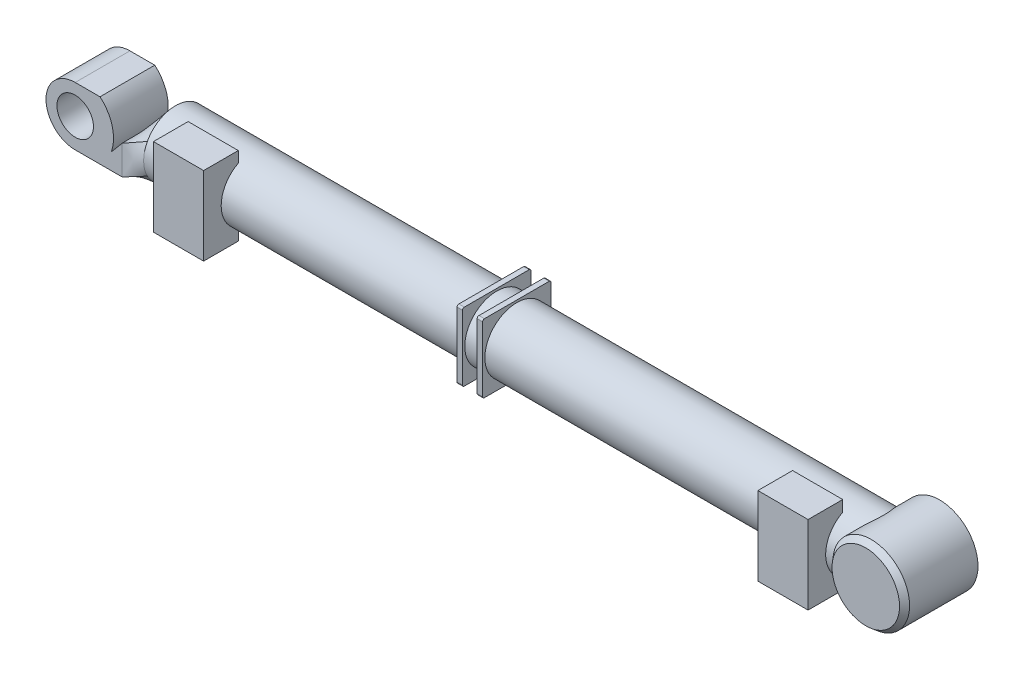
ISO-10303-21;
HEADER;
FILE_DESCRIPTION(('STEP AP214'),'2;1');
FILE_NAME('part.step','',(''),(''),'','','');
FILE_SCHEMA(('AUTOMOTIVE_DESIGN { 1 0 10303 214 1 1 1 1 }'));
ENDSEC;
DATA;
#1=APPLICATION_CONTEXT('core data for automotive mechanical design processes');
#2=APPLICATION_PROTOCOL_DEFINITION('international standard','automotive_design',2000,#1);
#3=PRODUCT_CONTEXT('',#1,'mechanical');
#4=PRODUCT('Part','Part','',(#3));
#5=PRODUCT_RELATED_PRODUCT_CATEGORY('part','',(#4));
#6=PRODUCT_DEFINITION_FORMATION('','',#4);
#7=PRODUCT_DEFINITION_CONTEXT('part definition',#1,'design');
#8=PRODUCT_DEFINITION('design','',#6,#7);
#9=PRODUCT_DEFINITION_SHAPE('','',#8);
#10=(LENGTH_UNIT() NAMED_UNIT(*) SI_UNIT(.MILLI.,.METRE.));
#11=(NAMED_UNIT(*) PLANE_ANGLE_UNIT() SI_UNIT($,.RADIAN.));
#12=(NAMED_UNIT(*) SI_UNIT($,.STERADIAN.) SOLID_ANGLE_UNIT());
#13=UNCERTAINTY_MEASURE_WITH_UNIT(LENGTH_MEASURE(1.E-05),#10,'distance_accuracy_value','');
#14=(GEOMETRIC_REPRESENTATION_CONTEXT(3) GLOBAL_UNCERTAINTY_ASSIGNED_CONTEXT((#13)) GLOBAL_UNIT_ASSIGNED_CONTEXT((#10,
#11,#12)) REPRESENTATION_CONTEXT('',''));
#15=CARTESIAN_POINT('',(0.,0.,0.));
#16=DIRECTION('',(0.,0.,1.));
#17=DIRECTION('',(1.,0.,0.));
#18=AXIS2_PLACEMENT_3D('',#15,#16,#17);
#19=CARTESIAN_POINT('',(4400.,0.,0.));
#20=DIRECTION('',(-1.,0.,0.));
#21=DIRECTION('',(0.,0.,1.));
#22=AXIS2_PLACEMENT_3D('',#19,#20,#21);
#23=CYLINDRICAL_SURFACE('',#22,175.);
#24=DIRECTION('',(-1.,0.,0.));
#25=VECTOR('',#24,1.);
#26=CARTESIAN_POINT('',(4137.5,155.,81.2403840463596));
#27=LINE('',#26,#25);
#28=CARTESIAN_POINT('',(4137.5,155.,81.2403840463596));
#29=VERTEX_POINT('',#28);
#30=CARTESIAN_POINT('',(3862.5,155.,81.2403840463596));
#31=VERTEX_POINT('',#30);
#32=EDGE_CURVE('E354',#29,#31,#27,.T.);
#33=ORIENTED_EDGE('',*,*,#32,.F.);
#34=CARTESIAN_POINT('',(4137.5,0.,0.));
#35=DIRECTION('',(-1.,0.,0.));
#36=DIRECTION('',(0.,0.,-1.));
#37=AXIS2_PLACEMENT_3D('',#34,#35,#36);
#38=CIRCLE('',#37,175.);
#39=CARTESIAN_POINT('',(4137.5,-155.,81.2403840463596));
#40=VERTEX_POINT('',#39);
#41=EDGE_CURVE('E352',#40,#29,#38,.T.);
#42=ORIENTED_EDGE('',*,*,#41,.F.);
#43=DIRECTION('',(-1.,0.,0.));
#44=VECTOR('',#43,1.);
#45=CARTESIAN_POINT('',(4137.5,-155.,81.2403840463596));
#46=LINE('',#45,#44);
#47=CARTESIAN_POINT('',(3862.5,-155.,81.2403840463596));
#48=VERTEX_POINT('',#47);
#49=EDGE_CURVE('E367',#40,#48,#46,.T.);
#50=ORIENTED_EDGE('',*,*,#49,.T.);
#51=CARTESIAN_POINT('',(3862.5,0.,0.));
#52=DIRECTION('',(-1.,0.,0.));
#53=DIRECTION('',(0.,0.,-1.));
#54=AXIS2_PLACEMENT_3D('',#51,#52,#53);
#55=CIRCLE('',#54,175.);
#56=EDGE_CURVE('E343',#48,#31,#55,.T.);
#57=ORIENTED_EDGE('',*,*,#56,.T.);
#58=EDGE_LOOP('',(#33,#42,#50,#57));
#59=FACE_BOUND('',#58,.T.);
#60=CARTESIAN_POINT('',(4190.,0.,175.));
#61=CARTESIAN_POINT('',(4190.00000143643,-2.07851005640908,174.999998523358));
#62=CARTESIAN_POINT('',(4190.03087510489,-4.15706454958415,174.962953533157));
#63=CARTESIAN_POINT('',(4190.15419110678,-8.30974612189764,174.814945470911));
#64=CARTESIAN_POINT('',(4190.24663533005,-10.3838730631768,174.703980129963));
#65=CARTESIAN_POINT('',(4190.49255729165,-14.5234631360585,174.408644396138));
#66=CARTESIAN_POINT('',(4190.64604092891,-16.5889254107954,174.224266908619));
#67=CARTESIAN_POINT('',(4191.01314398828,-20.7066833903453,173.782970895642));
#68=CARTESIAN_POINT('',(4191.2267629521,-22.7589791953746,173.526052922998));
#69=CARTESIAN_POINT('',(4191.71305522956,-26.8475198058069,172.940677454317));
#70=CARTESIAN_POINT('',(4191.98576288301,-28.8837545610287,172.612178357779));
#71=CARTESIAN_POINT('',(4192.58863662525,-32.9350973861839,171.885179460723));
#72=CARTESIAN_POINT('',(4192.91880287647,-34.9502053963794,171.486679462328));
#73=CARTESIAN_POINT('',(4193.63479706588,-38.9556420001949,170.621382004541));
#74=CARTESIAN_POINT('',(4194.02062368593,-40.9459711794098,170.154586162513));
#75=CARTESIAN_POINT('',(4194.8459305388,-44.8985962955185,169.154579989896));
#76=CARTESIAN_POINT('',(4195.28541071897,-46.8608922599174,168.621369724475));
#77=CARTESIAN_POINT('',(4196.21299296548,-50.742621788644,167.494018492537));
#78=CARTESIAN_POINT('',(4196.70078303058,-52.6622434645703,166.900267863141));
#79=CARTESIAN_POINT('',(4197.72488288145,-56.4682267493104,165.651292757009));
#80=CARTESIAN_POINT('',(4198.26119259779,-58.3545884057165,164.996068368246));
#81=CARTESIAN_POINT('',(4199.37986751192,-62.0915966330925,163.626384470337));
#82=CARTESIAN_POINT('',(4199.96222893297,-63.9422461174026,162.911929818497));
#83=CARTESIAN_POINT('',(4201.17060100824,-67.6061504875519,161.425886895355));
#84=CARTESIAN_POINT('',(4201.79661548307,-69.4194020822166,160.654293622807));
#85=CARTESIAN_POINT('',(4203.08971551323,-73.006678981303,159.056218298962));
#86=CARTESIAN_POINT('',(4203.75680211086,-74.7807032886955,158.229734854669));
#87=CARTESIAN_POINT('',(4205.12951512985,-78.2881934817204,156.52399878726));
#88=CARTESIAN_POINT('',(4205.83514502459,-80.0216556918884,155.644741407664));
#89=CARTESIAN_POINT('',(4207.28233833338,-83.4467458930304,153.835599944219));
#90=CARTESIAN_POINT('',(4208.02390332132,-85.1383720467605,152.905713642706));
#91=CARTESIAN_POINT('',(4209.54036766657,-88.4787733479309,150.997374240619));
#92=CARTESIAN_POINT('',(4210.3152682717,-90.1275468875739,150.018919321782));
#93=CARTESIAN_POINT('',(4212.18628097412,-93.9793815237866,147.647222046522));
#94=CARTESIAN_POINT('',(4213.29579172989,-96.1634889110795,146.233681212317));
#95=CARTESIAN_POINT('',(4215.56587537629,-100.448661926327,143.324019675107));
#96=CARTESIAN_POINT('',(4216.72645187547,-102.549721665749,141.827893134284));
#97=CARTESIAN_POINT('',(4219.09253543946,-106.668322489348,138.756871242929));
#98=CARTESIAN_POINT('',(4220.29805499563,-108.685840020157,137.181953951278));
#99=CARTESIAN_POINT('',(4222.74732595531,-112.636097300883,133.957493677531));
#100=CARTESIAN_POINT('',(4223.99107667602,-114.568838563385,132.307952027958));
#101=CARTESIAN_POINT('',(4226.51364987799,-118.354011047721,128.933212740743));
#102=CARTESIAN_POINT('',(4227.79255226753,-120.206229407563,127.207836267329));
#103=CARTESIAN_POINT('',(4230.37603493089,-123.82509075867,123.687988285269));
#104=CARTESIAN_POINT('',(4231.68061533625,-125.591733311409,121.893516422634));
#105=CARTESIAN_POINT('',(4234.30874466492,-129.039161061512,118.237921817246));
#106=CARTESIAN_POINT('',(4235.63229082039,-130.719958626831,116.376808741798));
#107=CARTESIAN_POINT('',(4238.29182229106,-133.995957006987,112.589311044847));
#108=CARTESIAN_POINT('',(4239.62780761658,-135.591157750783,110.662926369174));
#109=CARTESIAN_POINT('',(4242.32981699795,-138.724443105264,106.709917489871));
#110=CARTESIAN_POINT('',(4243.69594152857,-140.260937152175,104.682101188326));
#111=CARTESIAN_POINT('',(4246.42588199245,-143.244822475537,100.560399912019));
#112=CARTESIAN_POINT('',(4247.78969790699,-144.692213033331,98.4665144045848));
#113=CARTESIAN_POINT('',(4250.50686323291,-147.497853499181,94.2118835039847));
#114=CARTESIAN_POINT('',(4251.86020883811,-148.856072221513,92.0511151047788));
#115=CARTESIAN_POINT('',(4254.54637901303,-151.481917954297,87.662801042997));
#116=CARTESIAN_POINT('',(4255.87920383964,-152.749546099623,85.43525621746));
#117=CARTESIAN_POINT('',(4258.51045400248,-155.189948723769,80.9175843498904));
#118=CARTESIAN_POINT('',(4259.80895366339,-156.362941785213,78.6276188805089));
#119=CARTESIAN_POINT('',(4262.36271353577,-158.615497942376,73.9783525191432));
#120=CARTESIAN_POINT('',(4263.61797144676,-159.695056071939,71.6190479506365));
#121=CARTESIAN_POINT('',(4266.07026016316,-161.757192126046,66.8311312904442));
#122=CARTESIAN_POINT('',(4267.26733179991,-162.739838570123,64.4025697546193));
#123=CARTESIAN_POINT('',(4269.58777228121,-164.605183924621,59.4733207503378));
#124=CARTESIAN_POINT('',(4270.71115458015,-165.487901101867,56.9726465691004));
#125=CARTESIAN_POINT('',(4272.96728216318,-167.227100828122,51.6587982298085));
#126=CARTESIAN_POINT('',(4274.09095473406,-168.073292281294,48.8383658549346));
#127=CARTESIAN_POINT('',(4276.20020732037,-169.632935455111,43.1100096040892));
#128=CARTESIAN_POINT('',(4277.18580599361,-170.346405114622,40.2020976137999));
#129=CARTESIAN_POINT('',(4278.53659061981,-171.309502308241,35.7816149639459));
#130=CARTESIAN_POINT('',(4278.96524749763,-171.612453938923,34.2997413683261));
#131=CARTESIAN_POINT('',(4279.77659049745,-172.181814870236,31.3165731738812));
#132=CARTESIAN_POINT('',(4280.15928125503,-172.448227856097,29.8152805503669));
#133=CARTESIAN_POINT('',(4280.8748977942,-172.94334184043,26.7944675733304));
#134=CARTESIAN_POINT('',(4281.20781658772,-173.172037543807,25.2749446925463));
#135=CARTESIAN_POINT('',(4281.82010315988,-173.590465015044,22.2199689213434));
#136=CARTESIAN_POINT('',(4282.09947709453,-173.78020126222,20.6845178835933));
#137=CARTESIAN_POINT('',(4282.60452635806,-174.121787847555,17.5804315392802));
#138=CARTESIAN_POINT('',(4282.82947882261,-174.273129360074,16.011622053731));
#139=CARTESIAN_POINT('',(4283.21809106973,-174.533780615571,12.8629264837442));
#140=CARTESIAN_POINT('',(4283.38175090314,-174.643090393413,11.2830404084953));
#141=CARTESIAN_POINT('',(4283.64548137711,-174.818909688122,8.11568375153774));
#142=CARTESIAN_POINT('',(4283.7455564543,-174.88542219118,6.5282137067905));
#143=CARTESIAN_POINT('',(4283.88068255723,-174.975171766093,3.34927564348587));
#144=CARTESIAN_POINT('',(4283.91573362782,-174.998408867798,1.75780762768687));
#145=CARTESIAN_POINT('',(4283.92029289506,-175.001433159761,-1.42527088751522));
#146=CARTESIAN_POINT('',(4283.88980081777,-174.981220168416,-3.01688138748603));
#147=CARTESIAN_POINT('',(4283.76372537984,-174.897496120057,-6.19636387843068));
#148=CARTESIAN_POINT('',(4283.66814218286,-174.83398517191,-7.78423587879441));
#149=CARTESIAN_POINT('',(4283.41326225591,-174.664123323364,-10.9526837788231));
#150=CARTESIAN_POINT('',(4283.25395964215,-174.557768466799,-12.5332589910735));
#151=CARTESIAN_POINT('',(4282.87387561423,-174.302963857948,-15.6835700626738));
#152=CARTESIAN_POINT('',(4282.65309316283,-174.154513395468,-17.2533057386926));
#153=CARTESIAN_POINT('',(4282.13223058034,-173.802461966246,-20.5085835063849));
#154=CARTESIAN_POINT('',(4281.82709208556,-173.595307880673,-22.1929316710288));
#155=CARTESIAN_POINT('',(4281.15256379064,-173.134206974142,-25.5422076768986));
#156=CARTESIAN_POINT('',(4280.78317238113,-172.880258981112,-27.2071350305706));
#157=CARTESIAN_POINT('',(4279.98501898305,-172.327130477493,-30.5151159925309));
#158=CARTESIAN_POINT('',(4279.55625517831,-172.0279485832,-32.1581689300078));
#159=CARTESIAN_POINT('',(4278.64446839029,-171.385956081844,-35.4206005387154));
#160=CARTESIAN_POINT('',(4278.16143881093,-171.043140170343,-37.0399763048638));
#161=CARTESIAN_POINT('',(4276.63602116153,-169.949685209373,-41.8690449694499));
#162=CARTESIAN_POINT('',(4275.51938361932,-169.135459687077,-45.041259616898));
#163=CARTESIAN_POINT('',(4273.1288768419,-167.349759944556,-51.2795427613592));
#164=CARTESIAN_POINT('',(4271.85499247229,-166.378270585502,-54.3456010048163));
#165=CARTESIAN_POINT('',(4269.45969429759,-164.502416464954,-59.7526076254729));
#166=CARTESIAN_POINT('',(4268.36073526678,-163.62527579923,-62.1130986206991));
#167=CARTESIAN_POINT('',(4266.10101643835,-161.781298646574,-66.768867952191));
#168=CARTESIAN_POINT('',(4264.94024877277,-160.814450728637,-69.0641379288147));
#169=CARTESIAN_POINT('',(4262.56995611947,-158.793608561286,-73.5917012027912));
#170=CARTESIAN_POINT('',(4261.36040796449,-157.739572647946,-75.8239636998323));
#171=CARTESIAN_POINT('',(4258.90483334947,-155.546981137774,-80.2258207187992));
#172=CARTESIAN_POINT('',(4257.65880823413,-154.408428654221,-82.3954175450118));
#173=CARTESIAN_POINT('',(4255.13881324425,-152.04677815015,-86.6761833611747));
#174=CARTESIAN_POINT('',(4253.86480815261,-150.823568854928,-88.7872701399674));
#175=CARTESIAN_POINT('',(4251.29956774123,-148.295061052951,-92.9489267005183));
#176=CARTESIAN_POINT('',(4250.00833231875,-146.989762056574,-94.999496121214));
#177=CARTESIAN_POINT('',(4247.41706703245,-144.298087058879,-99.0401620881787));
#178=CARTESIAN_POINT('',(4246.11703911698,-142.91172853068,-101.030271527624));
#179=CARTESIAN_POINT('',(4243.51531680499,-140.058102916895,-104.950490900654));
#180=CARTESIAN_POINT('',(4242.21362240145,-138.590835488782,-106.880600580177));
#181=CARTESIAN_POINT('',(4239.54739192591,-135.496666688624,-110.779816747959));
#182=CARTESIAN_POINT('',(4238.18313337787,-133.865429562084,-112.745675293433));
#183=CARTESIAN_POINT('',(4235.46782872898,-130.513664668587,-116.609277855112));
#184=CARTESIAN_POINT('',(4234.11678275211,-128.793136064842,-118.5070212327));
#185=CARTESIAN_POINT('',(4231.43482818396,-125.262517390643,-122.232931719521));
#186=CARTESIAN_POINT('',(4230.10392294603,-123.452412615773,-124.061087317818));
#187=CARTESIAN_POINT('',(4227.4694178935,-119.742947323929,-127.645124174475));
#188=CARTESIAN_POINT('',(4226.16581787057,-117.843587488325,-129.401005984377));
#189=CARTESIAN_POINT('',(4223.59512940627,-113.959358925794,-132.834373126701));
#190=CARTESIAN_POINT('',(4222.32797755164,-111.97465585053,-134.511998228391));
#191=CARTESIAN_POINT('',(4219.83440032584,-107.916763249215,-137.788871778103));
#192=CARTESIAN_POINT('',(4218.60797569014,-105.843572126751,-139.388118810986));
#193=CARTESIAN_POINT('',(4216.20301693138,-101.610010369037,-142.503724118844));
#194=CARTESIAN_POINT('',(4215.02446960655,-99.4496640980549,-144.020105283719));
#195=CARTESIAN_POINT('',(4212.72182046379,-95.0424319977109,-146.965847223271));
#196=CARTESIAN_POINT('',(4211.59771489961,-92.7955521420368,-148.395213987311));
#197=CARTESIAN_POINT('',(4209.67824291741,-88.7767040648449,-150.823674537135));
#198=CARTESIAN_POINT('',(4208.86969455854,-87.02292619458,-151.842527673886));
#199=CARTESIAN_POINT('',(4207.29065675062,-83.4679066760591,-153.825390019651));
#200=CARTESIAN_POINT('',(4206.52016577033,-81.6666669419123,-154.789401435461));
#201=CARTESIAN_POINT('',(4205.02033494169,-78.0180768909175,-156.660084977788));
#202=CARTESIAN_POINT('',(4204.29099146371,-76.1707306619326,-157.566762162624));
#203=CARTESIAN_POINT('',(4202.87641412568,-72.4312638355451,-159.320358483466));
#204=CARTESIAN_POINT('',(4202.1911806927,-70.5391428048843,-160.167277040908));
#205=CARTESIAN_POINT('',(4200.86810206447,-66.7126950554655,-161.798455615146));
#206=CARTESIAN_POINT('',(4200.2302393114,-64.7783843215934,-162.582738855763));
#207=CARTESIAN_POINT('',(4199.00459401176,-60.8690636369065,-164.086388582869));
#208=CARTESIAN_POINT('',(4198.41681128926,-58.8940538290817,-164.805755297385));
#209=CARTESIAN_POINT('',(4197.29419132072,-54.9057993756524,-166.177013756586));
#210=CARTESIAN_POINT('',(4196.7593561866,-52.8925532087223,-166.828902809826));
#211=CARTESIAN_POINT('',(4195.74542666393,-48.8308364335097,-168.06264978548));
#212=CARTESIAN_POINT('',(4195.26633237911,-46.782365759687,-168.644507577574));
#213=CARTESIAN_POINT('',(4194.3629857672,-42.6374516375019,-169.740031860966));
#214=CARTESIAN_POINT('',(4193.9391894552,-40.5407588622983,-170.25313217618));
#215=CARTESIAN_POINT('',(4193.15330102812,-36.3187791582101,-171.203470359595));
#216=CARTESIAN_POINT('',(4192.79120899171,-34.1934921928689,-171.640708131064));
#217=CARTESIAN_POINT('',(4192.13089785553,-29.9184615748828,-172.437273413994));
#218=CARTESIAN_POINT('',(4191.83268007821,-27.7687174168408,-172.79659931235));
#219=CARTESIAN_POINT('',(4191.3019822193,-23.4493479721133,-173.435562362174));
#220=CARTESIAN_POINT('',(4191.06950194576,-21.279722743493,-173.715199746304));
#221=CARTESIAN_POINT('',(4190.67186799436,-16.9265382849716,-174.193238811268));
#222=CARTESIAN_POINT('',(4190.50667943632,-14.7429868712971,-174.391682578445));
#223=CARTESIAN_POINT('',(4190.24453342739,-10.3658658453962,-174.706506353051));
#224=CARTESIAN_POINT('',(4190.14757647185,-8.17229616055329,-174.82288576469));
#225=CARTESIAN_POINT('',(4190.02254275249,-3.78057830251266,-174.972952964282));
#226=CARTESIAN_POINT('',(4189.99445950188,-1.58243058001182,-175.006648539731));
#227=CARTESIAN_POINT('',(4190.00734420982,2.81333049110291,-174.991187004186));
#228=CARTESIAN_POINT('',(4190.04831015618,5.01094385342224,-174.942032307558));
#229=CARTESIAN_POINT('',(4190.18996505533,9.13697699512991,-174.772001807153));
#230=CARTESIAN_POINT('',(4190.28289825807,11.0660577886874,-174.660439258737));
#231=CARTESIAN_POINT('',(4190.52153504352,14.91618346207,-174.37383289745));
#232=CARTESIAN_POINT('',(4190.66723722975,16.8372285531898,-174.198790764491));
#233=CARTESIAN_POINT('',(4191.01066088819,20.6676921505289,-173.785951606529));
#234=CARTESIAN_POINT('',(4191.20837746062,22.5771117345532,-173.548160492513));
#235=CARTESIAN_POINT('',(4191.65485730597,26.3812286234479,-173.010753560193));
#236=CARTESIAN_POINT('',(4191.90362095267,28.2759258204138,-172.711137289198));
#237=CARTESIAN_POINT('',(4192.45100026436,32.0475281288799,-172.05121695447));
#238=CARTESIAN_POINT('',(4192.74961787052,33.9244325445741,-171.690910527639));
#239=CARTESIAN_POINT('',(4193.39529243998,37.6574418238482,-170.910950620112));
#240=CARTESIAN_POINT('',(4193.74234930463,39.5135467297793,-170.49129726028));
#241=CARTESIAN_POINT('',(4194.4833360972,43.2023153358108,-169.594112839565));
#242=CARTESIAN_POINT('',(4194.87726764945,45.0349782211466,-169.116579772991));
#243=CARTESIAN_POINT('',(4195.7102669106,48.6743230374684,-168.105256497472));
#244=CARTESIAN_POINT('',(4196.14933474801,50.481004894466,-167.571466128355));
#245=CARTESIAN_POINT('',(4197.07685414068,54.0898667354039,-166.441906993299));
#246=CARTESIAN_POINT('',(4197.56588215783,55.8916709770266,-165.845411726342));
#247=CARTESIAN_POINT('',(4198.58639690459,59.4643791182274,-164.598201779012));
#248=CARTESIAN_POINT('',(4199.11788732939,61.2352803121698,-163.947482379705));
#249=CARTESIAN_POINT('',(4200.2211353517,64.7440086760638,-162.593814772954));
#250=CARTESIAN_POINT('',(4200.79288809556,66.481839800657,-161.890872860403));
#251=CARTESIAN_POINT('',(4201.97457275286,69.9231082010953,-160.434568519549));
#252=CARTESIAN_POINT('',(4202.58450760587,71.6265428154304,-159.681202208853));
#253=CARTESIAN_POINT('',(4204.46843986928,76.6834178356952,-157.348130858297));
#254=CARTESIAN_POINT('',(4205.79658848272,79.9835036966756,-155.695424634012));
#255=CARTESIAN_POINT('',(4208.57935343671,86.4318977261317,-152.210265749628));
#256=CARTESIAN_POINT('',(4210.03398663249,89.5801855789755,-150.377789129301));
#257=CARTESIAN_POINT('',(4212.63672932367,94.87440457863,-147.073878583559));
#258=CARTESIAN_POINT('',(4213.75906618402,97.0578058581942,-145.641817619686));
#259=CARTESIAN_POINT('',(4216.05446534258,101.34072881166,-142.694828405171));
#260=CARTESIAN_POINT('',(4217.22753175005,103.440243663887,-141.179893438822));
#261=CARTESIAN_POINT('',(4219.61814628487,107.554871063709,-138.071000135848));
#262=CARTESIAN_POINT('',(4220.83570864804,109.569956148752,-136.477016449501));
#263=CARTESIAN_POINT('',(4223.30849216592,113.514445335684,-133.214195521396));
#264=CARTESIAN_POINT('',(4224.56371254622,115.443851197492,-131.545359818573));
#265=CARTESIAN_POINT('',(4227.10898698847,119.222064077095,-128.131185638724));
#266=CARTESIAN_POINT('',(4228.3991292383,121.070628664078,-126.385644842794));
#267=CARTESIAN_POINT('',(4231.00432759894,124.681268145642,-122.825119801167));
#268=CARTESIAN_POINT('',(4232.319383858,126.443342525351,-121.01013514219));
#269=CARTESIAN_POINT('',(4234.96754829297,129.880699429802,-117.31314428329));
#270=CARTESIAN_POINT('',(4236.30065355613,131.555995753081,-115.431148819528));
#271=CARTESIAN_POINT('',(4238.97825531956,134.820078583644,-111.601419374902));
#272=CARTESIAN_POINT('',(4240.32275182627,136.408865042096,-109.653685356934));
#273=CARTESIAN_POINT('',(4243.04002562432,139.52748746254,-105.658022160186));
#274=CARTESIAN_POINT('',(4244.41287842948,141.055759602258,-103.608923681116));
#275=CARTESIAN_POINT('',(4247.15477461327,144.022277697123,-99.4440562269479));
#276=CARTESIAN_POINT('',(4248.52381795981,145.46052289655,-97.3282866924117));
#277=CARTESIAN_POINT('',(4251.24970142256,148.246917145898,-93.0291131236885));
#278=CARTESIAN_POINT('',(4252.60653676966,149.595032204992,-90.8456840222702));
#279=CARTESIAN_POINT('',(4255.29756793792,152.199579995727,-86.4112257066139));
#280=CARTESIAN_POINT('',(4256.63176406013,153.456013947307,-84.1601973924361));
#281=CARTESIAN_POINT('',(4259.26283849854,155.872489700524,-79.5953425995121));
#282=CARTESIAN_POINT('',(4260.55980689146,157.032779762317,-77.2816997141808));
#283=CARTESIAN_POINT('',(4263.10750056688,159.258609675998,-72.5840968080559));
#284=CARTESIAN_POINT('',(4264.35822322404,160.324144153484,-70.2001328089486));
#285=CARTESIAN_POINT('',(4266.79776568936,162.356654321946,-65.3620385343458));
#286=CARTESIAN_POINT('',(4267.98663215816,163.323704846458,-62.9079633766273));
#287=CARTESIAN_POINT('',(4270.28634394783,165.156073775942,-57.9267792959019));
#288=CARTESIAN_POINT('',(4271.39720452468,166.021412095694,-55.3996847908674));
#289=CARTESIAN_POINT('',(4273.60600950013,167.709992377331,-50.0678232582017));
#290=CARTESIAN_POINT('',(4274.69594605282,168.524456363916,-47.2569270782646));
#291=CARTESIAN_POINT('',(4276.73491443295,170.021527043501,-41.5497006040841));
#292=CARTESIAN_POINT('',(4277.68396567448,170.70415190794,-38.6533821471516));
#293=CARTESIAN_POINT('',(4278.9782208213,171.62170053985,-34.2524858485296));
#294=CARTESIAN_POINT('',(4279.3877567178,171.90959480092,-32.7775495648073));
#295=CARTESIAN_POINT('',(4280.1604113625,172.449108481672,-29.8090582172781));
#296=CARTESIAN_POINT('',(4280.52353482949,172.700731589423,-28.3155050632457));
#297=CARTESIAN_POINT('',(4281.19971200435,173.166567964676,-25.3110844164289));
#298=CARTESIAN_POINT('',(4281.51275890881,173.380776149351,-23.8002146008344));
#299=CARTESIAN_POINT('',(4282.08519262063,173.770590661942,-20.7635433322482));
#300=CARTESIAN_POINT('',(4282.34458557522,173.946201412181,-19.2377436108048));
#301=CARTESIAN_POINT('',(4282.80937339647,174.259681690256,-16.1552402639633));
#302=CARTESIAN_POINT('',(4283.01408716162,174.397075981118,-14.5983851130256));
#303=CARTESIAN_POINT('',(4283.36269267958,174.630417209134,-11.4747619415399));
#304=CARTESIAN_POINT('',(4283.50658447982,174.72636417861,-9.90799392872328));
#305=CARTESIAN_POINT('',(4283.7315421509,174.876139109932,-6.76802761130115));
#306=CARTESIAN_POINT('',(4283.81261204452,174.929969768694,-5.19482972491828));
#307=CARTESIAN_POINT('',(4283.9107788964,174.995132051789,-2.0455511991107));
#308=CARTESIAN_POINT('',(4283.92787585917,175.006463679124,-0.469470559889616));
#309=CARTESIAN_POINT('',(4283.8978448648,174.986542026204,2.68215161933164));
#310=CARTESIAN_POINT('',(4283.85070286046,174.955279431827,4.25769296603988));
#311=CARTESIAN_POINT('',(4283.69285249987,174.85038282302,7.40415313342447));
#312=CARTESIAN_POINT('',(4283.58214434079,174.776748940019,8.97507196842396));
#313=CARTESIAN_POINT('',(4283.29871379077,174.587624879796,12.1089102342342));
#314=CARTESIAN_POINT('',(4283.12598521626,174.472130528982,13.6718288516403));
#315=CARTESIAN_POINT('',(4282.72086459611,174.200068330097,16.7863021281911));
#316=CARTESIAN_POINT('',(4282.4884713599,174.043499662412,18.3378565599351));
#317=CARTESIAN_POINT('',(4281.93930118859,173.671508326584,21.5908354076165));
#318=CARTESIAN_POINT('',(4281.61618378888,173.451601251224,23.2906771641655));
#319=CARTESIAN_POINT('',(4280.90527856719,172.964253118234,26.6698656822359));
#320=CARTESIAN_POINT('',(4280.51748872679,172.696810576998,28.3492118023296));
#321=CARTESIAN_POINT('',(4279.68235940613,172.116018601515,31.6850520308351));
#322=CARTESIAN_POINT('',(4279.23501694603,171.802666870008,33.3415449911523));
#323=CARTESIAN_POINT('',(4278.28610248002,171.131718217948,36.6299315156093));
#324=CARTESIAN_POINT('',(4277.78452385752,170.774115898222,38.2618220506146));
#325=CARTESIAN_POINT('',(4276.20368937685,169.635377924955,43.1271695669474));
#326=CARTESIAN_POINT('',(4275.05049070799,168.789789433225,46.3218887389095));
#327=CARTESIAN_POINT('',(4272.58859297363,166.9392202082,52.6024868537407));
#328=CARTESIAN_POINT('',(4271.27988017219,165.934225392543,55.6883561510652));
#329=CARTESIAN_POINT('',(4268.82264868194,163.995207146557,61.1320336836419));
#330=CARTESIAN_POINT('',(4267.69608687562,163.088686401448,63.5096986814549));
#331=CARTESIAN_POINT('',(4265.38252326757,161.184302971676,68.1984193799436));
#332=CARTESIAN_POINT('',(4264.19551383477,160.186428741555,70.5094666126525));
#333=CARTESIAN_POINT('',(4261.77421780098,158.101824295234,75.0672759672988));
#334=CARTESIAN_POINT('',(4260.53990886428,157.015051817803,77.3140068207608));
#335=CARTESIAN_POINT('',(4258.03639950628,154.755225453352,81.7435117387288));
#336=CARTESIAN_POINT('',(4256.76720036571,153.582174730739,83.9262881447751));
#337=CARTESIAN_POINT('',(4254.20250876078,151.149659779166,88.2320954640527));
#338=CARTESIAN_POINT('',(4252.9069835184,149.890082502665,90.3550429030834));
#339=CARTESIAN_POINT('',(4250.30046585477,147.286938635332,94.5390297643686));
#340=CARTESIAN_POINT('',(4248.98947334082,145.943371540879,96.6000688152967));
#341=CARTESIAN_POINT('',(4246.36055695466,143.173206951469,100.660175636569));
#342=CARTESIAN_POINT('',(4245.04263462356,141.746627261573,102.659256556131));
#343=CARTESIAN_POINT('',(4242.40709514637,138.810547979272,106.595782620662));
#344=CARTESIAN_POINT('',(4241.08947800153,137.301048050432,108.533227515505));
#345=CARTESIAN_POINT('',(4238.39690596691,134.123033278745,112.439582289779));
#346=CARTESIAN_POINT('',(4237.02231718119,132.450349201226,114.405355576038));
#347=CARTESIAN_POINT('',(4234.28873571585,129.013942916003,118.266997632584));
#348=CARTESIAN_POINT('',(4232.9297431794,127.250219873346,120.16286576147));
#349=CARTESIAN_POINT('',(4230.23439747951,123.631433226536,123.88302364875));
#350=CARTESIAN_POINT('',(4228.89804834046,121.776353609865,125.707300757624));
#351=CARTESIAN_POINT('',(4226.2553372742,117.975210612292,129.281301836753));
#352=CARTESIAN_POINT('',(4224.94897510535,116.029147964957,131.031026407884));
#353=CARTESIAN_POINT('',(4222.37565836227,112.049973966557,134.449508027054));
#354=CARTESIAN_POINT('',(4221.10863430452,110.017033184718,136.118411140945));
#355=CARTESIAN_POINT('',(4218.6183721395,105.8611039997,139.375018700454));
#356=CARTESIAN_POINT('',(4217.39513490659,103.738113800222,140.962721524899));
#357=CARTESIAN_POINT('',(4214.99988258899,99.4036515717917,144.052055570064));
#358=CARTESIAN_POINT('',(4213.82785141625,97.1922077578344,145.553713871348));
#359=CARTESIAN_POINT('',(4211.54175401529,92.6816120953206,148.466578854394));
#360=CARTESIAN_POINT('',(4210.42768335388,90.3824669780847,149.877792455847));
#361=CARTESIAN_POINT('',(4208.54483642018,86.3051253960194,152.251297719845));
#362=CARTESIAN_POINT('',(4207.76136358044,84.5462371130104,153.235192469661));
#363=CARTESIAN_POINT('',(4206.23311690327,80.9824277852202,155.148109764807));
#364=CARTESIAN_POINT('',(4205.48834167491,79.1775083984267,156.077134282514));
#365=CARTESIAN_POINT('',(4204.04047955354,75.5230363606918,157.877864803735));
#366=CARTESIAN_POINT('',(4203.3373901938,73.6734863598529,158.749574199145));
#367=CARTESIAN_POINT('',(4201.9757919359,69.9312343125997,160.433263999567));
#368=CARTESIAN_POINT('',(4201.31728337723,68.0385319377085,161.245243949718));
#369=CARTESIAN_POINT('',(4200.04842209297,64.2138753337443,162.806142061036));
#370=CARTESIAN_POINT('',(4199.43802086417,62.2819631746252,163.555123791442));
#371=CARTESIAN_POINT('',(4198.26748955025,58.3793133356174,164.988414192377));
#372=CARTESIAN_POINT('',(4197.70735856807,56.4085763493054,165.672724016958));
#373=CARTESIAN_POINT('',(4196.64016209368,52.4310580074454,166.974136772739));
#374=CARTESIAN_POINT('',(4196.13309187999,50.4242798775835,167.591245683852));
#375=CARTESIAN_POINT('',(4195.17459595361,46.3775484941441,168.755905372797));
#376=CARTESIAN_POINT('',(4194.72316811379,44.3375965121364,169.303458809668));
#377=CARTESIAN_POINT('',(4193.95034804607,40.5779567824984,170.239585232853));
#378=CARTESIAN_POINT('',(4193.61990388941,38.8629032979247,170.639351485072));
#379=CARTESIAN_POINT('',(4193.00026967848,35.4144088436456,171.388251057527));
#380=CARTESIAN_POINT('',(4192.71107843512,33.6809684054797,171.737385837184));
#381=CARTESIAN_POINT('',(4192.17513152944,30.1981465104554,172.383898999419));
#382=CARTESIAN_POINT('',(4191.9283711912,28.4487668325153,172.681283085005));
#383=CARTESIAN_POINT('',(4191.47825886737,24.9362883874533,173.223379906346));
#384=CARTESIAN_POINT('',(4191.27490726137,23.1731895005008,173.468092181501));
#385=CARTESIAN_POINT('',(4190.91247914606,19.6359207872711,173.904013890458));
#386=CARTESIAN_POINT('',(4190.75340099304,17.861751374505,174.095225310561));
#387=CARTESIAN_POINT('',(4190.48019414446,14.3049730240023,174.423499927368));
#388=CARTESIAN_POINT('',(4190.36606504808,12.5223641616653,174.560563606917));
#389=CARTESIAN_POINT('',(4190.18324110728,8.95123435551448,174.780078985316));
#390=CARTESIAN_POINT('',(4190.1145518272,7.16271271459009,174.862523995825));
#391=CARTESIAN_POINT('',(4190.02293037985,3.58280507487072,174.972485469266));
#392=CARTESIAN_POINT('',(4189.99999876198,1.79141904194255,175.000001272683));
#393=CARTESIAN_POINT('',(4190.,0.,175.));
#394=B_SPLINE_CURVE_WITH_KNOTS('',3,(#60,#61,#62,#63,#64,#65,#66,#67,#68,#69,#70,#71,#72,#73,
#74,#75,#76,#77,#78,#79,#80,#81,#82,#83,#84,#85,#86,#87,#88,#89,#90,#91,#92,#93,#94,#95,#96,#97,
#98,#99,#100,#101,#102,#103,#104,#105,#106,#107,#108,#109,#110,#111,#112,#113,#114,#115,#116,
#117,#118,#119,#120,#121,#122,#123,#124,#125,#126,#127,#128,#129,#130,#131,#132,#133,#134,#135,
#136,#137,#138,#139,#140,#141,#142,#143,#144,#145,#146,#147,#148,#149,#150,#151,#152,#153,#154,
#155,#156,#157,#158,#159,#160,#161,#162,#163,#164,#165,#166,#167,#168,#169,#170,#171,#172,#173,
#174,#175,#176,#177,#178,#179,#180,#181,#182,#183,#184,#185,#186,#187,#188,#189,#190,#191,#192,
#193,#194,#195,#196,#197,#198,#199,#200,#201,#202,#203,#204,#205,#206,#207,#208,#209,#210,#211,
#212,#213,#214,#215,#216,#217,#218,#219,#220,#221,#222,#223,#224,#225,#226,#227,#228,#229,#230,
#231,#232,#233,#234,#235,#236,#237,#238,#239,#240,#241,#242,#243,#244,#245,#246,#247,#248,#249,
#250,#251,#252,#253,#254,#255,#256,#257,#258,#259,#260,#261,#262,#263,#264,#265,#266,#267,#268,
#269,#270,#271,#272,#273,#274,#275,#276,#277,#278,#279,#280,#281,#282,#283,#284,#285,#286,#287,
#288,#289,#290,#291,#292,#293,#294,#295,#296,#297,#298,#299,#300,#301,#302,#303,#304,#305,#306,
#307,#308,#309,#310,#311,#312,#313,#314,#315,#316,#317,#318,#319,#320,#321,#322,#323,#324,#325,
#326,#327,#328,#329,#330,#331,#332,#333,#334,#335,#336,#337,#338,#339,#340,#341,#342,#343,#344,
#345,#346,#347,#348,#349,#350,#351,#352,#353,#354,#355,#356,#357,#358,#359,#360,#361,#362,#363,
#364,#365,#366,#367,#368,#369,#370,#371,#372,#373,#374,#375,#376,#377,#378,#379,#380,#381,#382,
#383,#384,#385,#386,#387,#388,#389,#390,#391,#392,#393),.UNSPECIFIED.,.T.,.F.,(4,2,2,2,2,2,2,2,
2,2,2,2,2,2,2,2,2,2,2,2,2,2,2,2,2,2,2,2,2,2,2,2,2,2,2,2,2,2,2,2,2,2,2,2,2,2,2,2,2,2,2,2,2,2,2,2,
2,2,2,2,2,2,2,2,2,2,2,2,2,2,2,2,2,2,2,2,2,2,2,2,2,2,2,2,2,2,2,2,2,2,2,2,2,2,2,2,2,2,2,2,2,2,2,2,
2,2,2,2,2,2,2,2,2,2,2,2,2,2,2,2,2,2,2,2,2,2,2,2,2,2,2,2,2,2,2,2,2,2,2,2,2,2,2,2,2,2,2,2,2,2,2,2,
2,2,2,2,2,2,2,2,2,2,2,2,2,2,4),(0.,6.23504923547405,12.4702898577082,18.7061332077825,
24.9419290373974,31.181358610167,37.4208058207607,43.6601052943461,49.8993986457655,
56.1007415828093,62.3020756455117,68.5029016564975,74.7042710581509,80.9057978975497,
87.1078845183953,93.3102430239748,99.5128339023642,107.994661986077,116.477090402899,
124.961894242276,133.446546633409,141.95241133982,150.458319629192,158.96299896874,
167.467685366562,176.128825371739,184.790035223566,193.454258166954,202.118372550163,
210.761865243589,219.405817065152,228.043612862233,236.679827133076,246.128984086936,
255.576862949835,260.292137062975,265.00693525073,269.722394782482,274.437311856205,
279.21178501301,283.98625420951,288.760390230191,293.534522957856,298.308675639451,
303.082816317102,307.857397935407,312.632060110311,317.802753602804,322.97357662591,
328.144557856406,333.316168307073,343.68567273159,354.05617595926,362.295791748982,
370.536458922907,378.781087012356,387.025411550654,395.280786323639,403.536210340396,
411.789861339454,420.04354728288,428.72930947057,437.41515307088,446.102427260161,
454.789635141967,463.460681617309,472.131884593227,480.800680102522,489.468878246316,
496.017879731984,502.566617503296,509.11477670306,515.662999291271,522.208782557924,
528.754542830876,535.300564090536,541.846597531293,548.443595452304,555.040601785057,
561.637744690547,568.234868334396,574.828568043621,581.422315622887,588.015442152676,
594.608376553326,600.410246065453,606.211962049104,612.013131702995,617.814343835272,
623.615781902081,629.417208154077,635.218835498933,641.020479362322,646.898873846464,
652.777780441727,658.655979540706,664.53463174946,676.291687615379,688.050312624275,
696.573886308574,705.098151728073,713.625168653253,722.152010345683,730.702878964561,
739.253798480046,747.803354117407,756.35291458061,765.055478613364,773.758115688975,
782.464016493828,791.169801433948,799.852356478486,808.535403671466,817.211802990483,
825.886500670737,835.249008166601,844.61022430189,849.281937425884,853.953175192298,
858.625047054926,863.296383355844,868.023447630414,872.750508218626,877.477266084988,
882.204023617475,886.931814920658,891.659591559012,896.387839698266,901.116182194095,
906.34666777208,911.577316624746,916.808227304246,922.039776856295,932.529226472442,
943.019603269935,951.365092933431,959.711638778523,968.062175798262,976.412406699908,
984.773762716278,993.135168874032,1001.4947881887,1009.85444142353,1018.62511712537,
1027.39587328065,1036.16817223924,1044.94040048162,1053.6961332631,1062.45204078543,
1071.20517727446,1079.95764328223,1086.44315620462,1092.92843585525,1099.4133313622,
1105.89827624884,1112.37659688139,1118.85480188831,1125.33242995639,1131.80981031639,
1137.1838785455,1142.55779183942,1147.93111254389,1153.30448023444,1158.67764840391,
1164.05076865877,1169.42454675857,1174.79838937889),.UNSPECIFIED.);
#395=CARTESIAN_POINT('',(4190.,0.,175.));
#396=VERTEX_POINT('',#395);
#397=EDGE_CURVE('E501',#396,#396,#394,.T.);
#398=ORIENTED_EDGE('',*,*,#397,.F.);
#399=EDGE_LOOP('',(#398));
#400=FACE_BOUND('',#399,.T.);
#401=CARTESIAN_POINT('',(2270.,0.,0.));
#402=DIRECTION('',(-1.,0.,0.));
#403=DIRECTION('',(0.,0.,1.));
#404=AXIS2_PLACEMENT_3D('',#401,#402,#403);
#405=CIRCLE('',#404,175.);
#406=CARTESIAN_POINT('',(2270.,0.,175.));
#407=VERTEX_POINT('',#406);
#408=EDGE_CURVE('E548',#407,#407,#405,.T.);
#409=ORIENTED_EDGE('',*,*,#408,.F.);
#410=EDGE_LOOP('',(#409));
#411=FACE_BOUND('',#410,.T.);
#412=ADVANCED_FACE('F74',(#59,#400,#411),#23,.T.);
#413=CARTESIAN_POINT('',(4400.,0.,187.5));
#414=DIRECTION('',(0.,0.,-1.));
#415=DIRECTION('',(-1.,0.,0.));
#416=AXIS2_PLACEMENT_3D('',#413,#414,#415);
#417=CYLINDRICAL_SURFACE('',#416,210.);
#418=CARTESIAN_POINT('',(4400.,0.,-187.5));
#419=DIRECTION('',(0.,0.,1.));
#420=DIRECTION('',(1.,0.,0.));
#421=AXIS2_PLACEMENT_3D('',#418,#419,#420);
#422=CIRCLE('',#421,210.);
#423=CARTESIAN_POINT('',(4610.,0.,-187.5));
#424=VERTEX_POINT('',#423);
#425=EDGE_CURVE('E438',#424,#424,#422,.T.);
#426=ORIENTED_EDGE('',*,*,#425,.T.);
#427=EDGE_LOOP('',(#426));
#428=FACE_BOUND('',#427,.T.);
#429=CARTESIAN_POINT('',(4400.,0.,187.5));
#430=DIRECTION('',(0.,0.,1.));
#431=DIRECTION('',(1.,0.,0.));
#432=AXIS2_PLACEMENT_3D('',#429,#430,#431);
#433=CIRCLE('',#432,210.);
#434=CARTESIAN_POINT('',(4610.,0.,187.5));
#435=VERTEX_POINT('',#434);
#436=EDGE_CURVE('E441',#435,#435,#433,.T.);
#437=ORIENTED_EDGE('',*,*,#436,.F.);
#438=EDGE_LOOP('',(#437));
#439=FACE_BOUND('',#438,.T.);
#440=ORIENTED_EDGE('',*,*,#397,.T.);
#441=EDGE_LOOP('',(#440));
#442=FACE_BOUND('',#441,.T.);
#443=ADVANCED_FACE('F553',(#428,#439,#442),#417,.T.);
#444=CARTESIAN_POINT('',(4400.,0.,-187.5));
#445=DIRECTION('',(0.,0.,1.));
#446=DIRECTION('',(1.,0.,0.));
#447=AXIS2_PLACEMENT_3D('',#444,#445,#446);
#448=PLANE('',#447);
#449=CARTESIAN_POINT('',(4400.,0.,-187.5));
#450=DIRECTION('',(0.,0.,-1.));
#451=DIRECTION('',(-1.,0.,0.));
#452=AXIS2_PLACEMENT_3D('',#449,#450,#451);
#453=CIRCLE('',#452,175.);
#454=CARTESIAN_POINT('',(4225.,0.,-187.5));
#455=VERTEX_POINT('',#454);
#456=EDGE_CURVE('E434',#455,#455,#453,.T.);
#457=ORIENTED_EDGE('',*,*,#456,.F.);
#458=EDGE_LOOP('',(#457));
#459=FACE_BOUND('',#458,.T.);
#460=ORIENTED_EDGE('',*,*,#425,.F.);
#461=EDGE_LOOP('',(#460));
#462=FACE_BOUND('',#461,.T.);
#463=ADVANCED_FACE('F558',(#459,#462),#448,.F.);
#464=CARTESIAN_POINT('',(4400.,0.,62.5));
#465=DIRECTION('',(0.,0.,-1.));
#466=DIRECTION('',(-1.,0.,0.));
#467=AXIS2_PLACEMENT_3D('',#464,#465,#466);
#468=CYLINDRICAL_SURFACE('',#467,175.);
#469=CARTESIAN_POINT('',(4400.,0.,62.5));
#470=DIRECTION('',(0.,0.,-1.));
#471=DIRECTION('',(-1.,0.,0.));
#472=AXIS2_PLACEMENT_3D('',#469,#470,#471);
#473=CIRCLE('',#472,175.);
#474=CARTESIAN_POINT('',(4225.,0.,62.5));
#475=VERTEX_POINT('',#474);
#476=EDGE_CURVE('E435',#475,#475,#473,.T.);
#477=ORIENTED_EDGE('',*,*,#476,.F.);
#478=EDGE_LOOP('',(#477));
#479=FACE_BOUND('',#478,.T.);
#480=ORIENTED_EDGE('',*,*,#456,.T.);
#481=EDGE_LOOP('',(#480));
#482=FACE_BOUND('',#481,.T.);
#483=ADVANCED_FACE('F844',(#479,#482),#468,.F.);
#484=CARTESIAN_POINT('',(4400.,0.,62.5));
#485=DIRECTION('',(0.,0.,-1.));
#486=DIRECTION('',(-1.,0.,0.));
#487=AXIS2_PLACEMENT_3D('',#484,#485,#486);
#488=PLANE('',#487);
#489=ORIENTED_EDGE('',*,*,#476,.T.);
#490=EDGE_LOOP('',(#489));
#491=FACE_BOUND('',#490,.T.);
#492=ADVANCED_FACE('F838',(#491),#488,.T.);
#493=CARTESIAN_POINT('',(4400.,0.,217.5));
#494=DIRECTION('',(0.,0.,-1.));
#495=DIRECTION('',(-1.,0.,0.));
#496=AXIS2_PLACEMENT_3D('',#493,#494,#495);
#497=CONICAL_SURFACE('',#496,184.999999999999,0.694738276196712);
#498=ORIENTED_EDGE('',*,*,#436,.T.);
#499=EDGE_LOOP('',(#498));
#500=FACE_BOUND('',#499,.T.);
#501=CARTESIAN_POINT('',(4400.,0.,217.5));
#502=DIRECTION('',(0.,0.,1.));
#503=DIRECTION('',(1.,0.,0.));
#504=AXIS2_PLACEMENT_3D('',#501,#502,#503);
#505=CIRCLE('',#504,184.999999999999);
#506=CARTESIAN_POINT('',(4585.,0.,217.5));
#507=VERTEX_POINT('',#506);
#508=EDGE_CURVE('E431',#507,#507,#505,.T.);
#509=ORIENTED_EDGE('',*,*,#508,.F.);
#510=EDGE_LOOP('',(#509));
#511=FACE_BOUND('',#510,.T.);
#512=ADVANCED_FACE('F835',(#500,#511),#497,.T.);
#513=CARTESIAN_POINT('',(4400.,0.,217.5));
#514=DIRECTION('',(0.,0.,1.));
#515=DIRECTION('',(1.,0.,0.));
#516=AXIS2_PLACEMENT_3D('',#513,#514,#515);
#517=PLANE('',#516);
#518=ORIENTED_EDGE('',*,*,#508,.T.);
#519=EDGE_LOOP('',(#518));
#520=FACE_BOUND('',#519,.T.);
#521=ADVANCED_FACE('F834',(#520),#517,.T.);
#522=CARTESIAN_POINT('',(2270.,-187.5,-187.5));
#523=DIRECTION('',(0.,0.,1.));
#524=DIRECTION('',(1.,0.,0.));
#525=AXIS2_PLACEMENT_3D('',#522,#523,#524);
#526=PLANE('',#525);
#527=DIRECTION('',(0.,1.,0.));
#528=VECTOR('',#527,1.);
#529=CARTESIAN_POINT('',(2270.,-187.5,-187.5));
#530=LINE('',#529,#528);
#531=CARTESIAN_POINT('',(2270.,-177.5,-187.5));
#532=VERTEX_POINT('',#531);
#533=CARTESIAN_POINT('',(2270.,177.5,-187.5));
#534=VERTEX_POINT('',#533);
#535=EDGE_CURVE('E406',#532,#534,#530,.T.);
#536=ORIENTED_EDGE('',*,*,#535,.F.);
#537=DIRECTION('',(-1.,0.,0.));
#538=VECTOR('',#537,1.);
#539=CARTESIAN_POINT('',(2270.,-177.5,-187.5));
#540=LINE('',#539,#538);
#541=CARTESIAN_POINT('',(2240.,-177.5,-187.5));
#542=VERTEX_POINT('',#541);
#543=EDGE_CURVE('E792',#532,#542,#540,.T.);
#544=ORIENTED_EDGE('',*,*,#543,.T.);
#545=DIRECTION('',(0.,1.,0.));
#546=VECTOR('',#545,1.);
#547=CARTESIAN_POINT('',(2240.,-187.5,-187.5));
#548=LINE('',#547,#546);
#549=CARTESIAN_POINT('',(2240.,177.5,-187.5));
#550=VERTEX_POINT('',#549);
#551=EDGE_CURVE('E420',#542,#550,#548,.T.);
#552=ORIENTED_EDGE('',*,*,#551,.T.);
#553=DIRECTION('',(-1.,0.,0.));
#554=VECTOR('',#553,1.);
#555=CARTESIAN_POINT('',(2270.,177.5,-187.5));
#556=LINE('',#555,#554);
#557=EDGE_CURVE('E803',#550,#534,#556,.F.);
#558=ORIENTED_EDGE('',*,*,#557,.T.);
#559=EDGE_LOOP('',(#536,#544,#552,#558));
#560=FACE_BOUND('',#559,.T.);
#561=ADVANCED_FACE('F831',(#560),#526,.F.);
#562=CARTESIAN_POINT('',(2270.,187.5,187.5));
#563=DIRECTION('',(0.,-1.,0.));
#564=DIRECTION('',(0.,0.,-1.));
#565=AXIS2_PLACEMENT_3D('',#562,#563,#564);
#566=PLANE('',#565);
#567=DIRECTION('',(0.,0.,1.));
#568=VECTOR('',#567,1.);
#569=CARTESIAN_POINT('',(2240.,187.5,187.5));
#570=LINE('',#569,#568);
#571=CARTESIAN_POINT('',(2240.,187.5,-177.5));
#572=VERTEX_POINT('',#571);
#573=CARTESIAN_POINT('',(2240.,187.5,177.5));
#574=VERTEX_POINT('',#573);
#575=EDGE_CURVE('E423',#572,#574,#570,.T.);
#576=ORIENTED_EDGE('',*,*,#575,.T.);
#577=DIRECTION('',(-1.,0.,0.));
#578=VECTOR('',#577,1.);
#579=CARTESIAN_POINT('',(2270.,187.5,177.5));
#580=LINE('',#579,#578);
#581=CARTESIAN_POINT('',(2270.,187.5,177.5));
#582=VERTEX_POINT('',#581);
#583=EDGE_CURVE('E661',#574,#582,#580,.F.);
#584=ORIENTED_EDGE('',*,*,#583,.T.);
#585=DIRECTION('',(0.,0.,1.));
#586=VECTOR('',#585,1.);
#587=CARTESIAN_POINT('',(2270.,187.5,187.5));
#588=LINE('',#587,#586);
#589=CARTESIAN_POINT('',(2270.,187.5,-177.5));
#590=VERTEX_POINT('',#589);
#591=EDGE_CURVE('E409',#590,#582,#588,.T.);
#592=ORIENTED_EDGE('',*,*,#591,.F.);
#593=DIRECTION('',(-1.,0.,0.));
#594=VECTOR('',#593,1.);
#595=CARTESIAN_POINT('',(2270.,187.5,-177.5));
#596=LINE('',#595,#594);
#597=EDGE_CURVE('E665',#590,#572,#596,.T.);
#598=ORIENTED_EDGE('',*,*,#597,.T.);
#599=EDGE_LOOP('',(#576,#584,#592,#598));
#600=FACE_BOUND('',#599,.T.);
#601=ADVANCED_FACE('F779',(#600),#566,.F.);
#602=CARTESIAN_POINT('',(2270.,-187.5,187.5));
#603=DIRECTION('',(0.,0.,-1.));
#604=DIRECTION('',(-1.,0.,0.));
#605=AXIS2_PLACEMENT_3D('',#602,#603,#604);
#606=PLANE('',#605);
#607=DIRECTION('',(0.,-1.,0.));
#608=VECTOR('',#607,1.);
#609=CARTESIAN_POINT('',(2240.,-187.5,187.5));
#610=LINE('',#609,#608);
#611=CARTESIAN_POINT('',(2240.,177.5,187.5));
#612=VERTEX_POINT('',#611);
#613=CARTESIAN_POINT('',(2240.,-177.5,187.5));
#614=VERTEX_POINT('',#613);
#615=EDGE_CURVE('E426',#612,#614,#610,.T.);
#616=ORIENTED_EDGE('',*,*,#615,.T.);
#617=DIRECTION('',(-1.,0.,0.));
#618=VECTOR('',#617,1.);
#619=CARTESIAN_POINT('',(2270.,-177.5,187.5));
#620=LINE('',#619,#618);
#621=CARTESIAN_POINT('',(2270.,-177.5,187.5));
#622=VERTEX_POINT('',#621);
#623=EDGE_CURVE('E757',#614,#622,#620,.F.);
#624=ORIENTED_EDGE('',*,*,#623,.T.);
#625=DIRECTION('',(0.,-1.,0.));
#626=VECTOR('',#625,1.);
#627=CARTESIAN_POINT('',(2270.,-187.5,187.5));
#628=LINE('',#627,#626);
#629=CARTESIAN_POINT('',(2270.,177.5,187.5));
#630=VERTEX_POINT('',#629);
#631=EDGE_CURVE('E413',#630,#622,#628,.T.);
#632=ORIENTED_EDGE('',*,*,#631,.F.);
#633=DIRECTION('',(-1.,0.,0.));
#634=VECTOR('',#633,1.);
#635=CARTESIAN_POINT('',(2270.,177.5,187.5));
#636=LINE('',#635,#634);
#637=EDGE_CURVE('E765',#630,#612,#636,.T.);
#638=ORIENTED_EDGE('',*,*,#637,.T.);
#639=EDGE_LOOP('',(#616,#624,#632,#638));
#640=FACE_BOUND('',#639,.T.);
#641=ADVANCED_FACE('F820',(#640),#606,.F.);
#642=CARTESIAN_POINT('',(2270.,-187.5,187.5));
#643=DIRECTION('',(0.,1.,0.));
#644=DIRECTION('',(0.,0.,1.));
#645=AXIS2_PLACEMENT_3D('',#642,#643,#644);
#646=PLANE('',#645);
#647=DIRECTION('',(0.,0.,-1.));
#648=VECTOR('',#647,1.);
#649=CARTESIAN_POINT('',(2240.,-187.5,187.5));
#650=LINE('',#649,#648);
#651=CARTESIAN_POINT('',(2240.,-187.5,177.5));
#652=VERTEX_POINT('',#651);
#653=CARTESIAN_POINT('',(2240.,-187.5,-177.5));
#654=VERTEX_POINT('',#653);
#655=EDGE_CURVE('E410',#652,#654,#650,.T.);
#656=ORIENTED_EDGE('',*,*,#655,.T.);
#657=DIRECTION('',(-1.,0.,0.));
#658=VECTOR('',#657,1.);
#659=CARTESIAN_POINT('',(2270.,-187.5,-177.5));
#660=LINE('',#659,#658);
#661=CARTESIAN_POINT('',(2270.,-187.5,-177.5));
#662=VERTEX_POINT('',#661);
#663=EDGE_CURVE('E798',#654,#662,#660,.F.);
#664=ORIENTED_EDGE('',*,*,#663,.T.);
#665=DIRECTION('',(0.,0.,-1.));
#666=VECTOR('',#665,1.);
#667=CARTESIAN_POINT('',(2270.,-187.5,187.5));
#668=LINE('',#667,#666);
#669=CARTESIAN_POINT('',(2270.,-187.5,177.5));
#670=VERTEX_POINT('',#669);
#671=EDGE_CURVE('E416',#670,#662,#668,.T.);
#672=ORIENTED_EDGE('',*,*,#671,.F.);
#673=DIRECTION('',(-1.,0.,0.));
#674=VECTOR('',#673,1.);
#675=CARTESIAN_POINT('',(2270.,-187.5,177.5));
#676=LINE('',#675,#674);
#677=EDGE_CURVE('E759',#670,#652,#676,.T.);
#678=ORIENTED_EDGE('',*,*,#677,.T.);
#679=EDGE_LOOP('',(#656,#664,#672,#678));
#680=FACE_BOUND('',#679,.T.);
#681=ADVANCED_FACE('F812',(#680),#646,.F.);
#682=CARTESIAN_POINT('',(2270.,0.,0.));
#683=DIRECTION('',(-1.,0.,0.));
#684=DIRECTION('',(0.,0.,1.));
#685=AXIS2_PLACEMENT_3D('',#682,#683,#684);
#686=PLANE('',#685);
#687=ORIENTED_EDGE('',*,*,#408,.T.);
#688=EDGE_LOOP('',(#687));
#689=FACE_BOUND('',#688,.T.);
#690=ORIENTED_EDGE('',*,*,#671,.T.);
#691=CARTESIAN_POINT('',(2270.,-177.5,-177.5));
#692=DIRECTION('',(-1.,0.,0.));
#693=DIRECTION('',(0.,0.,1.));
#694=AXIS2_PLACEMENT_3D('',#691,#692,#693);
#695=CIRCLE('',#694,10.);
#696=EDGE_CURVE('E762',#662,#532,#695,.F.);
#697=ORIENTED_EDGE('',*,*,#696,.T.);
#698=ORIENTED_EDGE('',*,*,#535,.T.);
#699=CARTESIAN_POINT('',(2270.,177.5,-177.5));
#700=DIRECTION('',(-1.,0.,0.));
#701=DIRECTION('',(0.,0.,1.));
#702=AXIS2_PLACEMENT_3D('',#699,#700,#701);
#703=CIRCLE('',#702,10.);
#704=EDGE_CURVE('E767',#534,#590,#703,.F.);
#705=ORIENTED_EDGE('',*,*,#704,.T.);
#706=ORIENTED_EDGE('',*,*,#591,.T.);
#707=CARTESIAN_POINT('',(2270.,177.5,177.5));
#708=DIRECTION('',(-1.,0.,0.));
#709=DIRECTION('',(0.,0.,1.));
#710=AXIS2_PLACEMENT_3D('',#707,#708,#709);
#711=CIRCLE('',#710,10.);
#712=EDGE_CURVE('E763',#582,#630,#711,.F.);
#713=ORIENTED_EDGE('',*,*,#712,.T.);
#714=ORIENTED_EDGE('',*,*,#631,.T.);
#715=CARTESIAN_POINT('',(2270.,-177.5,177.5));
#716=DIRECTION('',(-1.,0.,0.));
#717=DIRECTION('',(0.,0.,1.));
#718=AXIS2_PLACEMENT_3D('',#715,#716,#717);
#719=CIRCLE('',#718,10.);
#720=EDGE_CURVE('E756',#622,#670,#719,.F.);
#721=ORIENTED_EDGE('',*,*,#720,.T.);
#722=EDGE_LOOP('',(#690,#697,#698,#705,#706,#713,#714,#721));
#723=FACE_BOUND('',#722,.T.);
#724=ADVANCED_FACE('F799',(#689,#723),#686,.F.);
#725=CARTESIAN_POINT('',(2240.,0.,0.));
#726=DIRECTION('',(-1.,0.,0.));
#727=DIRECTION('',(0.,0.,1.));
#728=AXIS2_PLACEMENT_3D('',#725,#726,#727);
#729=PLANE('',#728);
#730=CARTESIAN_POINT('',(2240.,0.,0.));
#731=DIRECTION('',(-1.,0.,0.));
#732=DIRECTION('',(0.,0.,1.));
#733=AXIS2_PLACEMENT_3D('',#730,#731,#732);
#734=CIRCLE('',#733,175.);
#735=CARTESIAN_POINT('',(2240.,0.,175.));
#736=VERTEX_POINT('',#735);
#737=EDGE_CURVE('E419',#736,#736,#734,.T.);
#738=ORIENTED_EDGE('',*,*,#737,.F.);
#739=EDGE_LOOP('',(#738));
#740=FACE_BOUND('',#739,.T.);
#741=ORIENTED_EDGE('',*,*,#551,.F.);
#742=CARTESIAN_POINT('',(2240.,-177.5,-177.5));
#743=DIRECTION('',(-1.,0.,0.));
#744=DIRECTION('',(0.,0.,1.));
#745=AXIS2_PLACEMENT_3D('',#742,#743,#744);
#746=CIRCLE('',#745,10.);
#747=EDGE_CURVE('E790',#542,#654,#746,.T.);
#748=ORIENTED_EDGE('',*,*,#747,.T.);
#749=ORIENTED_EDGE('',*,*,#655,.F.);
#750=CARTESIAN_POINT('',(2240.,-177.5,177.5));
#751=DIRECTION('',(-1.,0.,0.));
#752=DIRECTION('',(0.,0.,1.));
#753=AXIS2_PLACEMENT_3D('',#750,#751,#752);
#754=CIRCLE('',#753,10.);
#755=EDGE_CURVE('E788',#652,#614,#754,.T.);
#756=ORIENTED_EDGE('',*,*,#755,.T.);
#757=ORIENTED_EDGE('',*,*,#615,.F.);
#758=CARTESIAN_POINT('',(2240.,177.5,177.5));
#759=DIRECTION('',(-1.,0.,0.));
#760=DIRECTION('',(0.,0.,1.));
#761=AXIS2_PLACEMENT_3D('',#758,#759,#760);
#762=CIRCLE('',#761,10.);
#763=EDGE_CURVE('E786',#612,#574,#762,.T.);
#764=ORIENTED_EDGE('',*,*,#763,.T.);
#765=ORIENTED_EDGE('',*,*,#575,.F.);
#766=CARTESIAN_POINT('',(2240.,177.5,-177.5));
#767=DIRECTION('',(-1.,0.,0.));
#768=DIRECTION('',(0.,0.,1.));
#769=AXIS2_PLACEMENT_3D('',#766,#767,#768);
#770=CIRCLE('',#769,10.);
#771=EDGE_CURVE('E784',#572,#550,#770,.T.);
#772=ORIENTED_EDGE('',*,*,#771,.T.);
#773=EDGE_LOOP('',(#741,#748,#749,#756,#757,#764,#765,#772));
#774=FACE_BOUND('',#773,.T.);
#775=ADVANCED_FACE('F524',(#740,#774),#729,.T.);
#776=CARTESIAN_POINT('',(2160.,0.,0.));
#777=DIRECTION('',(1.,0.,0.));
#778=DIRECTION('',(0.,0.,-1.));
#779=AXIS2_PLACEMENT_3D('',#776,#777,#778);
#780=CIRCLE('',#779,175.);
#781=CARTESIAN_POINT('',(2160.,0.,-175.));
#782=VERTEX_POINT('',#781);
#783=EDGE_CURVE('E395',#782,#782,#780,.T.);
#784=ORIENTED_EDGE('',*,*,#783,.T.);
#785=EDGE_LOOP('',(#784));
#786=FACE_BOUND('',#785,.T.);
#787=ORIENTED_EDGE('',*,*,#737,.T.);
#788=EDGE_LOOP('',(#787));
#789=FACE_BOUND('',#788,.T.);
#790=ADVANCED_FACE('F518',(#786,#789),#23,.T.);
#791=CARTESIAN_POINT('',(2270.,-177.5,-177.5));
#792=DIRECTION('',(-1.,0.,0.));
#793=DIRECTION('',(0.,0.,1.));
#794=AXIS2_PLACEMENT_3D('',#791,#792,#793);
#795=CYLINDRICAL_SURFACE('',#794,10.);
#796=ORIENTED_EDGE('',*,*,#696,.F.);
#797=ORIENTED_EDGE('',*,*,#663,.F.);
#798=ORIENTED_EDGE('',*,*,#747,.F.);
#799=ORIENTED_EDGE('',*,*,#543,.F.);
#800=EDGE_LOOP('',(#796,#797,#798,#799));
#801=FACE_BOUND('',#800,.T.);
#802=ADVANCED_FACE('F523',(#801),#795,.T.);
#803=CARTESIAN_POINT('',(2270.,-177.5,177.5));
#804=DIRECTION('',(-1.,0.,0.));
#805=DIRECTION('',(0.,0.,1.));
#806=AXIS2_PLACEMENT_3D('',#803,#804,#805);
#807=CYLINDRICAL_SURFACE('',#806,10.);
#808=ORIENTED_EDGE('',*,*,#720,.F.);
#809=ORIENTED_EDGE('',*,*,#623,.F.);
#810=ORIENTED_EDGE('',*,*,#755,.F.);
#811=ORIENTED_EDGE('',*,*,#677,.F.);
#812=EDGE_LOOP('',(#808,#809,#810,#811));
#813=FACE_BOUND('',#812,.T.);
#814=ADVANCED_FACE('F745',(#813),#807,.T.);
#815=CARTESIAN_POINT('',(2270.,177.5,177.5));
#816=DIRECTION('',(-1.,0.,0.));
#817=DIRECTION('',(0.,0.,1.));
#818=AXIS2_PLACEMENT_3D('',#815,#816,#817);
#819=CYLINDRICAL_SURFACE('',#818,10.);
#820=ORIENTED_EDGE('',*,*,#712,.F.);
#821=ORIENTED_EDGE('',*,*,#583,.F.);
#822=ORIENTED_EDGE('',*,*,#763,.F.);
#823=ORIENTED_EDGE('',*,*,#637,.F.);
#824=EDGE_LOOP('',(#820,#821,#822,#823));
#825=FACE_BOUND('',#824,.T.);
#826=ADVANCED_FACE('F742',(#825),#819,.T.);
#827=CARTESIAN_POINT('',(2270.,177.5,-177.5));
#828=DIRECTION('',(-1.,0.,0.));
#829=DIRECTION('',(0.,0.,1.));
#830=AXIS2_PLACEMENT_3D('',#827,#828,#829);
#831=CYLINDRICAL_SURFACE('',#830,10.);
#832=ORIENTED_EDGE('',*,*,#704,.F.);
#833=ORIENTED_EDGE('',*,*,#557,.F.);
#834=ORIENTED_EDGE('',*,*,#771,.F.);
#835=ORIENTED_EDGE('',*,*,#597,.F.);
#836=EDGE_LOOP('',(#832,#833,#834,#835));
#837=FACE_BOUND('',#836,.T.);
#838=ADVANCED_FACE('F739',(#837),#831,.T.);
#839=CARTESIAN_POINT('',(2130.,-187.5,-187.5));
#840=DIRECTION('',(0.,0.,-1.));
#841=DIRECTION('',(-1.,0.,0.));
#842=AXIS2_PLACEMENT_3D('',#839,#840,#841);
#843=PLANE('',#842);
#844=DIRECTION('',(0.,1.,0.));
#845=VECTOR('',#844,1.);
#846=CARTESIAN_POINT('',(2160.,-187.5,-187.5));
#847=LINE('',#846,#845);
#848=CARTESIAN_POINT('',(2160.,-177.5,-187.5));
#849=VERTEX_POINT('',#848);
#850=CARTESIAN_POINT('',(2160.,177.5,-187.5));
#851=VERTEX_POINT('',#850);
#852=EDGE_CURVE('E381',#849,#851,#847,.T.);
#853=ORIENTED_EDGE('',*,*,#852,.F.);
#854=DIRECTION('',(1.,0.,0.));
#855=VECTOR('',#854,1.);
#856=CARTESIAN_POINT('',(2130.,-177.5,-187.5));
#857=LINE('',#856,#855);
#858=CARTESIAN_POINT('',(2130.,-177.5,-187.5));
#859=VERTEX_POINT('',#858);
#860=EDGE_CURVE('E682',#849,#859,#857,.F.);
#861=ORIENTED_EDGE('',*,*,#860,.T.);
#862=DIRECTION('',(0.,1.,0.));
#863=VECTOR('',#862,1.);
#864=CARTESIAN_POINT('',(2130.,-187.5,-187.5));
#865=LINE('',#864,#863);
#866=CARTESIAN_POINT('',(2130.,177.5,-187.5));
#867=VERTEX_POINT('',#866);
#868=EDGE_CURVE('E382',#859,#867,#865,.T.);
#869=ORIENTED_EDGE('',*,*,#868,.T.);
#870=DIRECTION('',(1.,0.,0.));
#871=VECTOR('',#870,1.);
#872=CARTESIAN_POINT('',(2130.,177.5,-187.5));
#873=LINE('',#872,#871);
#874=EDGE_CURVE('E679',#867,#851,#873,.T.);
#875=ORIENTED_EDGE('',*,*,#874,.T.);
#876=EDGE_LOOP('',(#853,#861,#869,#875));
#877=FACE_BOUND('',#876,.T.);
#878=ADVANCED_FACE('F712',(#877),#843,.T.);
#879=CARTESIAN_POINT('',(2130.,-187.5,187.5));
#880=DIRECTION('',(0.,-1.,0.));
#881=DIRECTION('',(0.,0.,-1.));
#882=AXIS2_PLACEMENT_3D('',#879,#880,#881);
#883=PLANE('',#882);
#884=DIRECTION('',(0.,0.,-1.));
#885=VECTOR('',#884,1.);
#886=CARTESIAN_POINT('',(2130.,-187.5,187.5));
#887=LINE('',#886,#885);
#888=CARTESIAN_POINT('',(2130.,-187.5,177.5));
#889=VERTEX_POINT('',#888);
#890=CARTESIAN_POINT('',(2130.,-187.5,-177.5));
#891=VERTEX_POINT('',#890);
#892=EDGE_CURVE('E385',#889,#891,#887,.T.);
#893=ORIENTED_EDGE('',*,*,#892,.T.);
#894=DIRECTION('',(1.,0.,0.));
#895=VECTOR('',#894,1.);
#896=CARTESIAN_POINT('',(2130.,-187.5,-177.5));
#897=LINE('',#896,#895);
#898=CARTESIAN_POINT('',(2160.,-187.5,-177.5));
#899=VERTEX_POINT('',#898);
#900=EDGE_CURVE('E663',#891,#899,#897,.T.);
#901=ORIENTED_EDGE('',*,*,#900,.T.);
#902=DIRECTION('',(0.,0.,-1.));
#903=VECTOR('',#902,1.);
#904=CARTESIAN_POINT('',(2160.,-187.5,187.5));
#905=LINE('',#904,#903);
#906=CARTESIAN_POINT('',(2160.,-187.5,177.5));
#907=VERTEX_POINT('',#906);
#908=EDGE_CURVE('E398',#907,#899,#905,.T.);
#909=ORIENTED_EDGE('',*,*,#908,.F.);
#910=DIRECTION('',(1.,0.,0.));
#911=VECTOR('',#910,1.);
#912=CARTESIAN_POINT('',(2130.,-187.5,177.5));
#913=LINE('',#912,#911);
#914=EDGE_CURVE('E660',#907,#889,#913,.F.);
#915=ORIENTED_EDGE('',*,*,#914,.T.);
#916=EDGE_LOOP('',(#893,#901,#909,#915));
#917=FACE_BOUND('',#916,.T.);
#918=ADVANCED_FACE('F720',(#917),#883,.T.);
#919=CARTESIAN_POINT('',(2130.,-187.5,187.5));
#920=DIRECTION('',(0.,0.,1.));
#921=DIRECTION('',(1.,0.,0.));
#922=AXIS2_PLACEMENT_3D('',#919,#920,#921);
#923=PLANE('',#922);
#924=DIRECTION('',(0.,-1.,0.));
#925=VECTOR('',#924,1.);
#926=CARTESIAN_POINT('',(2130.,-187.5,187.5));
#927=LINE('',#926,#925);
#928=CARTESIAN_POINT('',(2130.,177.5,187.5));
#929=VERTEX_POINT('',#928);
#930=CARTESIAN_POINT('',(2130.,-177.5,187.5));
#931=VERTEX_POINT('',#930);
#932=EDGE_CURVE('E389',#929,#931,#927,.T.);
#933=ORIENTED_EDGE('',*,*,#932,.T.);
#934=DIRECTION('',(1.,0.,0.));
#935=VECTOR('',#934,1.);
#936=CARTESIAN_POINT('',(2130.,-177.5,187.5));
#937=LINE('',#936,#935);
#938=CARTESIAN_POINT('',(2160.,-177.5,187.5));
#939=VERTEX_POINT('',#938);
#940=EDGE_CURVE('E694',#931,#939,#937,.T.);
#941=ORIENTED_EDGE('',*,*,#940,.T.);
#942=DIRECTION('',(0.,-1.,0.));
#943=VECTOR('',#942,1.);
#944=CARTESIAN_POINT('',(2160.,-187.5,187.5));
#945=LINE('',#944,#943);
#946=CARTESIAN_POINT('',(2160.,177.5,187.5));
#947=VERTEX_POINT('',#946);
#948=EDGE_CURVE('E401',#947,#939,#945,.T.);
#949=ORIENTED_EDGE('',*,*,#948,.F.);
#950=DIRECTION('',(1.,0.,0.));
#951=VECTOR('',#950,1.);
#952=CARTESIAN_POINT('',(2130.,177.5,187.5));
#953=LINE('',#952,#951);
#954=EDGE_CURVE('E692',#947,#929,#953,.F.);
#955=ORIENTED_EDGE('',*,*,#954,.T.);
#956=EDGE_LOOP('',(#933,#941,#949,#955));
#957=FACE_BOUND('',#956,.T.);
#958=ADVANCED_FACE('F728',(#957),#923,.T.);
#959=CARTESIAN_POINT('',(2130.,187.5,187.5));
#960=DIRECTION('',(0.,1.,0.));
#961=DIRECTION('',(0.,0.,1.));
#962=AXIS2_PLACEMENT_3D('',#959,#960,#961);
#963=PLANE('',#962);
#964=DIRECTION('',(0.,0.,1.));
#965=VECTOR('',#964,1.);
#966=CARTESIAN_POINT('',(2130.,187.5,187.5));
#967=LINE('',#966,#965);
#968=CARTESIAN_POINT('',(2130.,187.5,-177.5));
#969=VERTEX_POINT('',#968);
#970=CARTESIAN_POINT('',(2130.,187.5,177.5));
#971=VERTEX_POINT('',#970);
#972=EDGE_CURVE('E392',#969,#971,#967,.T.);
#973=ORIENTED_EDGE('',*,*,#972,.T.);
#974=DIRECTION('',(1.,0.,0.));
#975=VECTOR('',#974,1.);
#976=CARTESIAN_POINT('',(2130.,187.5,177.5));
#977=LINE('',#976,#975);
#978=CARTESIAN_POINT('',(2160.,187.5,177.5));
#979=VERTEX_POINT('',#978);
#980=EDGE_CURVE('E12',#971,#979,#977,.T.);
#981=ORIENTED_EDGE('',*,*,#980,.T.);
#982=DIRECTION('',(0.,0.,1.));
#983=VECTOR('',#982,1.);
#984=CARTESIAN_POINT('',(2160.,187.5,187.5));
#985=LINE('',#984,#983);
#986=CARTESIAN_POINT('',(2160.,187.5,-177.5));
#987=VERTEX_POINT('',#986);
#988=EDGE_CURVE('E386',#987,#979,#985,.T.);
#989=ORIENTED_EDGE('',*,*,#988,.F.);
#990=DIRECTION('',(1.,0.,0.));
#991=VECTOR('',#990,1.);
#992=CARTESIAN_POINT('',(2130.,187.5,-177.5));
#993=LINE('',#992,#991);
#994=EDGE_CURVE('E82',#987,#969,#993,.F.);
#995=ORIENTED_EDGE('',*,*,#994,.T.);
#996=EDGE_LOOP('',(#973,#981,#989,#995));
#997=FACE_BOUND('',#996,.T.);
#998=ADVANCED_FACE('F700',(#997),#963,.T.);
#999=CARTESIAN_POINT('',(2130.,0.,0.));
#1000=DIRECTION('',(1.,0.,0.));
#1001=DIRECTION('',(0.,0.,1.));
#1002=AXIS2_PLACEMENT_3D('',#999,#1000,#1001);
#1003=PLANE('',#1002);
#1004=CARTESIAN_POINT('',(2130.,0.,0.));
#1005=DIRECTION('',(1.,0.,0.));
#1006=DIRECTION('',(0.,0.,-1.));
#1007=AXIS2_PLACEMENT_3D('',#1004,#1005,#1006);
#1008=CIRCLE('',#1007,175.);
#1009=CARTESIAN_POINT('',(2130.,0.,-175.));
#1010=VERTEX_POINT('',#1009);
#1011=EDGE_CURVE('E658',#1010,#1010,#1008,.T.);
#1012=ORIENTED_EDGE('',*,*,#1011,.T.);
#1013=EDGE_LOOP('',(#1012));
#1014=FACE_BOUND('',#1013,.T.);
#1015=ORIENTED_EDGE('',*,*,#868,.F.);
#1016=CARTESIAN_POINT('',(2130.,-177.5,-177.5));
#1017=DIRECTION('',(1.,0.,0.));
#1018=DIRECTION('',(0.,0.,-1.));
#1019=AXIS2_PLACEMENT_3D('',#1016,#1017,#1018);
#1020=CIRCLE('',#1019,10.);
#1021=EDGE_CURVE('E690',#859,#891,#1020,.F.);
#1022=ORIENTED_EDGE('',*,*,#1021,.T.);
#1023=ORIENTED_EDGE('',*,*,#892,.F.);
#1024=CARTESIAN_POINT('',(2130.,-177.5,177.5));
#1025=DIRECTION('',(1.,0.,0.));
#1026=DIRECTION('',(0.,0.,-1.));
#1027=AXIS2_PLACEMENT_3D('',#1024,#1025,#1026);
#1028=CIRCLE('',#1027,10.);
#1029=EDGE_CURVE('E688',#889,#931,#1028,.F.);
#1030=ORIENTED_EDGE('',*,*,#1029,.T.);
#1031=ORIENTED_EDGE('',*,*,#932,.F.);
#1032=CARTESIAN_POINT('',(2130.,177.5,177.5));
#1033=DIRECTION('',(1.,0.,0.));
#1034=DIRECTION('',(0.,0.,-1.));
#1035=AXIS2_PLACEMENT_3D('',#1032,#1033,#1034);
#1036=CIRCLE('',#1035,10.);
#1037=EDGE_CURVE('E686',#929,#971,#1036,.F.);
#1038=ORIENTED_EDGE('',*,*,#1037,.T.);
#1039=ORIENTED_EDGE('',*,*,#972,.F.);
#1040=CARTESIAN_POINT('',(2130.,177.5,-177.5));
#1041=DIRECTION('',(1.,0.,0.));
#1042=DIRECTION('',(0.,0.,-1.));
#1043=AXIS2_PLACEMENT_3D('',#1040,#1041,#1042);
#1044=CIRCLE('',#1043,10.);
#1045=EDGE_CURVE('E684',#969,#867,#1044,.F.);
#1046=ORIENTED_EDGE('',*,*,#1045,.T.);
#1047=EDGE_LOOP('',(#1015,#1022,#1023,#1030,#1031,#1038,#1039,#1046));
#1048=FACE_BOUND('',#1047,.T.);
#1049=ADVANCED_FACE('F706',(#1014,#1048),#1003,.F.);
#1050=CARTESIAN_POINT('',(2160.,0.,0.));
#1051=DIRECTION('',(1.,0.,0.));
#1052=DIRECTION('',(0.,0.,1.));
#1053=AXIS2_PLACEMENT_3D('',#1050,#1051,#1052);
#1054=PLANE('',#1053);
#1055=ORIENTED_EDGE('',*,*,#783,.F.);
#1056=EDGE_LOOP('',(#1055));
#1057=FACE_BOUND('',#1056,.T.);
#1058=ORIENTED_EDGE('',*,*,#908,.T.);
#1059=CARTESIAN_POINT('',(2160.,-177.5,-177.5));
#1060=DIRECTION('',(1.,0.,0.));
#1061=DIRECTION('',(0.,0.,-1.));
#1062=AXIS2_PLACEMENT_3D('',#1059,#1060,#1061);
#1063=CIRCLE('',#1062,10.);
#1064=EDGE_CURVE('E677',#899,#849,#1063,.T.);
#1065=ORIENTED_EDGE('',*,*,#1064,.T.);
#1066=ORIENTED_EDGE('',*,*,#852,.T.);
#1067=CARTESIAN_POINT('',(2160.,177.5,-177.5));
#1068=DIRECTION('',(1.,0.,0.));
#1069=DIRECTION('',(0.,0.,-1.));
#1070=AXIS2_PLACEMENT_3D('',#1067,#1068,#1069);
#1071=CIRCLE('',#1070,10.);
#1072=EDGE_CURVE('E671',#851,#987,#1071,.T.);
#1073=ORIENTED_EDGE('',*,*,#1072,.T.);
#1074=ORIENTED_EDGE('',*,*,#988,.T.);
#1075=CARTESIAN_POINT('',(2160.,177.5,177.5));
#1076=DIRECTION('',(1.,0.,0.));
#1077=DIRECTION('',(0.,0.,-1.));
#1078=AXIS2_PLACEMENT_3D('',#1075,#1076,#1077);
#1079=CIRCLE('',#1078,10.);
#1080=EDGE_CURVE('E673',#979,#947,#1079,.T.);
#1081=ORIENTED_EDGE('',*,*,#1080,.T.);
#1082=ORIENTED_EDGE('',*,*,#948,.T.);
#1083=CARTESIAN_POINT('',(2160.,-177.5,177.5));
#1084=DIRECTION('',(1.,0.,0.));
#1085=DIRECTION('',(0.,0.,-1.));
#1086=AXIS2_PLACEMENT_3D('',#1083,#1084,#1085);
#1087=CIRCLE('',#1086,10.);
#1088=EDGE_CURVE('E675',#939,#907,#1087,.T.);
#1089=ORIENTED_EDGE('',*,*,#1088,.T.);
#1090=EDGE_LOOP('',(#1058,#1065,#1066,#1073,#1074,#1081,#1082,#1089));
#1091=FACE_BOUND('',#1090,.T.);
#1092=ADVANCED_FACE('F715',(#1057,#1091),#1054,.T.);
#1093=CARTESIAN_POINT('',(0.,0.,150.));
#1094=DIRECTION('',(0.,0.,-1.));
#1095=DIRECTION('',(-1.,0.,0.));
#1096=AXIS2_PLACEMENT_3D('',#1093,#1094,#1095);
#1097=CYLINDRICAL_SURFACE('',#1096,100.);
#1098=CARTESIAN_POINT('',(0.,0.,150.));
#1099=DIRECTION('',(0.,0.,1.));
#1100=DIRECTION('',(1.,0.,0.));
#1101=AXIS2_PLACEMENT_3D('',#1098,#1099,#1100);
#1102=CIRCLE('',#1101,100.);
#1103=CARTESIAN_POINT('',(100.,0.,150.));
#1104=VERTEX_POINT('',#1103);
#1105=EDGE_CURVE('E452',#1104,#1104,#1102,.T.);
#1106=ORIENTED_EDGE('',*,*,#1105,.T.);
#1107=EDGE_LOOP('',(#1106));
#1108=FACE_BOUND('',#1107,.T.);
#1109=CARTESIAN_POINT('',(0.,0.,-150.));
#1110=DIRECTION('',(0.,0.,1.));
#1111=DIRECTION('',(1.,0.,0.));
#1112=AXIS2_PLACEMENT_3D('',#1109,#1110,#1111);
#1113=CIRCLE('',#1112,100.);
#1114=CARTESIAN_POINT('',(100.,0.,-150.));
#1115=VERTEX_POINT('',#1114);
#1116=EDGE_CURVE('E450',#1115,#1115,#1113,.T.);
#1117=ORIENTED_EDGE('',*,*,#1116,.F.);
#1118=EDGE_LOOP('',(#1117));
#1119=FACE_BOUND('',#1118,.T.);
#1120=ADVANCED_FACE('F568',(#1108,#1119),#1097,.F.);
#1121=CARTESIAN_POINT('',(0.,160.,150.));
#1122=DIRECTION('',(0.,-1.,0.));
#1123=DIRECTION('',(0.,0.,-1.));
#1124=AXIS2_PLACEMENT_3D('',#1121,#1122,#1123);
#1125=PLANE('',#1124);
#1126=DIRECTION('',(-1.,0.,0.));
#1127=VECTOR('',#1126,1.);
#1128=CARTESIAN_POINT('',(0.,160.,-150.));
#1129=LINE('',#1128,#1127);
#1130=CARTESIAN_POINT('',(136.014705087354,160.,-150.));
#1131=VERTEX_POINT('',#1130);
#1132=CARTESIAN_POINT('',(0.,160.,-150.));
#1133=VERTEX_POINT('',#1132);
#1134=EDGE_CURVE('E462',#1131,#1133,#1129,.T.);
#1135=ORIENTED_EDGE('',*,*,#1134,.T.);
#1136=DIRECTION('',(0.,0.,-1.));
#1137=VECTOR('',#1136,1.);
#1138=CARTESIAN_POINT('',(0.,160.,150.));
#1139=LINE('',#1138,#1137);
#1140=CARTESIAN_POINT('',(0.,160.,150.));
#1141=VERTEX_POINT('',#1140);
#1142=EDGE_CURVE('E467',#1141,#1133,#1139,.T.);
#1143=ORIENTED_EDGE('',*,*,#1142,.F.);
#1144=DIRECTION('',(-1.,0.,0.));
#1145=VECTOR('',#1144,1.);
#1146=CARTESIAN_POINT('',(0.,160.,150.));
#1147=LINE('',#1146,#1145);
#1148=CARTESIAN_POINT('',(136.014705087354,160.,150.));
#1149=VERTEX_POINT('',#1148);
#1150=EDGE_CURVE('E465',#1149,#1141,#1147,.T.);
#1151=ORIENTED_EDGE('',*,*,#1150,.F.);
#1152=DIRECTION('',(0.,0.,-1.));
#1153=VECTOR('',#1152,1.);
#1154=CARTESIAN_POINT('',(136.014705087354,160.,150.));
#1155=LINE('',#1154,#1153);
#1156=EDGE_CURVE('E476',#1149,#1131,#1155,.T.);
#1157=ORIENTED_EDGE('',*,*,#1156,.T.);
#1158=EDGE_LOOP('',(#1135,#1143,#1151,#1157));
#1159=FACE_BOUND('',#1158,.T.);
#1160=ADVANCED_FACE('F625',(#1159),#1125,.F.);
#1161=CARTESIAN_POINT('',(0.,0.,150.));
#1162=DIRECTION('',(0.,0.,-1.));
#1163=DIRECTION('',(-1.,0.,0.));
#1164=AXIS2_PLACEMENT_3D('',#1161,#1162,#1163);
#1165=CYLINDRICAL_SURFACE('',#1164,160.);
#1166=CARTESIAN_POINT('',(0.,0.,-150.));
#1167=DIRECTION('',(0.,0.,1.));
#1168=DIRECTION('',(1.,0.,0.));
#1169=AXIS2_PLACEMENT_3D('',#1166,#1167,#1168);
#1170=CIRCLE('',#1169,160.);
#1171=CARTESIAN_POINT('',(0.,-160.,-150.));
#1172=VERTEX_POINT('',#1171);
#1173=EDGE_CURVE('E455',#1133,#1172,#1170,.T.);
#1174=ORIENTED_EDGE('',*,*,#1173,.T.);
#1175=DIRECTION('',(0.,0.,-1.));
#1176=VECTOR('',#1175,1.);
#1177=CARTESIAN_POINT('',(0.,-160.,150.));
#1178=LINE('',#1177,#1176);
#1179=CARTESIAN_POINT('',(0.,-160.,150.));
#1180=VERTEX_POINT('',#1179);
#1181=EDGE_CURVE('E479',#1180,#1172,#1178,.T.);
#1182=ORIENTED_EDGE('',*,*,#1181,.F.);
#1183=CARTESIAN_POINT('',(0.,0.,150.));
#1184=DIRECTION('',(0.,0.,1.));
#1185=DIRECTION('',(1.,0.,0.));
#1186=AXIS2_PLACEMENT_3D('',#1183,#1184,#1185);
#1187=CIRCLE('',#1186,160.);
#1188=EDGE_CURVE('E458',#1141,#1180,#1187,.T.);
#1189=ORIENTED_EDGE('',*,*,#1188,.F.);
#1190=ORIENTED_EDGE('',*,*,#1142,.T.);
#1191=EDGE_LOOP('',(#1174,#1182,#1189,#1190));
#1192=FACE_BOUND('',#1191,.T.);
#1193=ADVANCED_FACE('F623',(#1192),#1165,.T.);
#1194=CARTESIAN_POINT('',(0.,0.,150.));
#1195=DIRECTION('',(0.,0.,-1.));
#1196=DIRECTION('',(-1.,0.,0.));
#1197=AXIS2_PLACEMENT_3D('',#1194,#1195,#1196);
#1198=CYLINDRICAL_SURFACE('',#1197,210.);
#1199=DIRECTION('',(0.,0.,-1.));
#1200=VECTOR('',#1199,1.);
#1201=CARTESIAN_POINT('',(197.335450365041,-71.8242300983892,150.));
#1202=LINE('',#1201,#1200);
#1203=CARTESIAN_POINT('',(197.335450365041,-71.8242300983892,150.));
#1204=VERTEX_POINT('',#1203);
#1205=CARTESIAN_POINT('',(197.335450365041,-71.8242300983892,-150.));
#1206=VERTEX_POINT('',#1205);
#1207=EDGE_CURVE('E447',#1204,#1206,#1202,.T.);
#1208=ORIENTED_EDGE('',*,*,#1207,.T.);
#1209=CARTESIAN_POINT('',(0.,0.,-150.));
#1210=DIRECTION('',(0.,0.,1.));
#1211=DIRECTION('',(-1.,0.,0.));
#1212=AXIS2_PLACEMENT_3D('',#1209,#1210,#1211);
#1213=CIRCLE('',#1212,210.);
#1214=EDGE_CURVE('E471',#1206,#1131,#1213,.T.);
#1215=ORIENTED_EDGE('',*,*,#1214,.T.);
#1216=ORIENTED_EDGE('',*,*,#1156,.F.);
#1217=CARTESIAN_POINT('',(0.,0.,150.));
#1218=DIRECTION('',(0.,0.,1.));
#1219=DIRECTION('',(-1.,0.,0.));
#1220=AXIS2_PLACEMENT_3D('',#1217,#1218,#1219);
#1221=CIRCLE('',#1220,210.);
#1222=EDGE_CURVE('E463',#1204,#1149,#1221,.T.);
#1223=ORIENTED_EDGE('',*,*,#1222,.F.);
#1224=EDGE_LOOP('',(#1208,#1215,#1216,#1223));
#1225=FACE_BOUND('',#1224,.T.);
#1226=ADVANCED_FACE('F621',(#1225),#1198,.T.);
#1227=CARTESIAN_POINT('',(0.,0.,-150.));
#1228=DIRECTION('',(0.,0.,1.));
#1229=DIRECTION('',(1.,0.,0.));
#1230=AXIS2_PLACEMENT_3D('',#1227,#1228,#1229);
#1231=PLANE('',#1230);
#1232=ORIENTED_EDGE('',*,*,#1173,.F.);
#1233=ORIENTED_EDGE('',*,*,#1134,.F.);
#1234=ORIENTED_EDGE('',*,*,#1214,.F.);
#1235=DIRECTION('',(-0.641107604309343,-0.767451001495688,0.));
#1236=VECTOR('',#1235,1.);
#1237=CARTESIAN_POINT('',(197.335450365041,-71.8242300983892,-150.));
#1238=LINE('',#1237,#1236);
#1239=CARTESIAN_POINT('',(257.335450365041,0.,-150.));
#1240=VERTEX_POINT('',#1239);
#1241=EDGE_CURVE('E444',#1240,#1206,#1238,.T.);
#1242=ORIENTED_EDGE('',*,*,#1241,.F.);
#1243=DIRECTION('',(0.,1.,0.));
#1244=VECTOR('',#1243,1.);
#1245=CARTESIAN_POINT('',(257.335450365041,0.,-150.));
#1246=LINE('',#1245,#1244);
#1247=CARTESIAN_POINT('',(257.335450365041,-160.,-150.));
#1248=VERTEX_POINT('',#1247);
#1249=EDGE_CURVE('E549',#1248,#1240,#1246,.T.);
#1250=ORIENTED_EDGE('',*,*,#1249,.F.);
#1251=DIRECTION('',(1.,0.,0.));
#1252=VECTOR('',#1251,1.);
#1253=CARTESIAN_POINT('',(0.,-160.,-150.));
#1254=LINE('',#1253,#1252);
#1255=EDGE_CURVE('E470',#1172,#1248,#1254,.T.);
#1256=ORIENTED_EDGE('',*,*,#1255,.F.);
#1257=EDGE_LOOP('',(#1232,#1233,#1234,#1242,#1250,#1256));
#1258=FACE_BOUND('',#1257,.T.);
#1259=ORIENTED_EDGE('',*,*,#1116,.T.);
#1260=EDGE_LOOP('',(#1259));
#1261=FACE_BOUND('',#1260,.T.);
#1262=ADVANCED_FACE('F620',(#1258,#1261),#1231,.F.);
#1263=CARTESIAN_POINT('',(0.,-160.,150.));
#1264=DIRECTION('',(0.,1.,0.));
#1265=DIRECTION('',(0.,0.,1.));
#1266=AXIS2_PLACEMENT_3D('',#1263,#1264,#1265);
#1267=PLANE('',#1266);
#1268=ORIENTED_EDGE('',*,*,#1255,.T.);
#1269=DIRECTION('',(0.,0.,-1.));
#1270=VECTOR('',#1269,1.);
#1271=CARTESIAN_POINT('',(257.335450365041,-160.,150.));
#1272=LINE('',#1271,#1270);
#1273=CARTESIAN_POINT('',(257.335450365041,-160.,150.));
#1274=VERTEX_POINT('',#1273);
#1275=EDGE_CURVE('E502',#1274,#1248,#1272,.T.);
#1276=ORIENTED_EDGE('',*,*,#1275,.F.);
#1277=DIRECTION('',(1.,0.,0.));
#1278=VECTOR('',#1277,1.);
#1279=CARTESIAN_POINT('',(0.,-160.,150.));
#1280=LINE('',#1279,#1278);
#1281=EDGE_CURVE('E461',#1180,#1274,#1280,.T.);
#1282=ORIENTED_EDGE('',*,*,#1281,.F.);
#1283=ORIENTED_EDGE('',*,*,#1181,.T.);
#1284=EDGE_LOOP('',(#1268,#1276,#1282,#1283));
#1285=FACE_BOUND('',#1284,.T.);
#1286=ADVANCED_FACE('F611',(#1285),#1267,.F.);
#1287=CARTESIAN_POINT('',(0.,0.,150.));
#1288=DIRECTION('',(0.,0.,1.));
#1289=DIRECTION('',(1.,0.,0.));
#1290=AXIS2_PLACEMENT_3D('',#1287,#1288,#1289);
#1291=PLANE('',#1290);
#1292=ORIENTED_EDGE('',*,*,#1188,.T.);
#1293=ORIENTED_EDGE('',*,*,#1281,.T.);
#1294=DIRECTION('',(0.,1.,0.));
#1295=VECTOR('',#1294,1.);
#1296=CARTESIAN_POINT('',(257.335450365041,-71.8242300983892,150.));
#1297=LINE('',#1296,#1295);
#1298=CARTESIAN_POINT('',(257.335450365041,0.,150.));
#1299=VERTEX_POINT('',#1298);
#1300=EDGE_CURVE('E583',#1274,#1299,#1297,.T.);
#1301=ORIENTED_EDGE('',*,*,#1300,.T.);
#1302=DIRECTION('',(-0.641107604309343,-0.767451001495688,0.));
#1303=VECTOR('',#1302,1.);
#1304=CARTESIAN_POINT('',(197.335450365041,-71.8242300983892,150.));
#1305=LINE('',#1304,#1303);
#1306=EDGE_CURVE('E451',#1299,#1204,#1305,.T.);
#1307=ORIENTED_EDGE('',*,*,#1306,.T.);
#1308=ORIENTED_EDGE('',*,*,#1222,.T.);
#1309=ORIENTED_EDGE('',*,*,#1150,.T.);
#1310=EDGE_LOOP('',(#1292,#1293,#1301,#1307,#1308,#1309));
#1311=FACE_BOUND('',#1310,.T.);
#1312=ORIENTED_EDGE('',*,*,#1105,.F.);
#1313=EDGE_LOOP('',(#1312));
#1314=FACE_BOUND('',#1313,.T.);
#1315=ADVANCED_FACE('F566',(#1311,#1314),#1291,.T.);
#1316=CARTESIAN_POINT('',(197.335450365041,-71.8242300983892,150.));
#1317=DIRECTION('',(0.767451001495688,-0.641107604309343,0.));
#1318=DIRECTION('',(0.641107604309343,0.767451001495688,0.));
#1319=AXIS2_PLACEMENT_3D('',#1316,#1317,#1318);
#1320=PLANE('',#1319);
#1321=ORIENTED_EDGE('',*,*,#1241,.T.);
#1322=ORIENTED_EDGE('',*,*,#1207,.F.);
#1323=ORIENTED_EDGE('',*,*,#1306,.F.);
#1324=DIRECTION('',(0.,0.,-1.));
#1325=VECTOR('',#1324,1.);
#1326=CARTESIAN_POINT('',(257.335450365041,0.,150.));
#1327=LINE('',#1326,#1325);
#1328=EDGE_CURVE('E576',#1299,#1240,#1327,.T.);
#1329=ORIENTED_EDGE('',*,*,#1328,.T.);
#1330=EDGE_LOOP('',(#1321,#1322,#1323,#1329));
#1331=FACE_BOUND('',#1330,.T.);
#1332=ADVANCED_FACE('F561',(#1331),#1320,.F.);
#1333=CARTESIAN_POINT('',(400.,82.3529411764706,-154.411764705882));
#1334=CARTESIAN_POINT('',(257.335450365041,0.,-150.));
#1335=CARTESIAN_POINT('',(400.,76.2975778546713,-157.641291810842));
#1336=CARTESIAN_POINT('',(257.335450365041,-6.66666666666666,-150.));
#1337=CARTESIAN_POINT('',(400.,69.9617894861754,-160.561409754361));
#1338=CARTESIAN_POINT('',(257.335450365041,-13.3333333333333,-150.));
#1339=CARTESIAN_POINT('',(400.,56.8306633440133,-165.665005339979));
#1340=CARTESIAN_POINT('',(257.335450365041,-26.6666666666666,-150.));
#1341=CARTESIAN_POINT('',(400.,50.0355029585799,-167.848126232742));
#1342=CARTESIAN_POINT('',(257.335450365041,-33.3333333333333,-150.));
#1343=CARTESIAN_POINT('',(400.,36.1183431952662,-171.382642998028));
#1344=CARTESIAN_POINT('',(257.335450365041,-46.6666666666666,-150.));
#1345=CARTESIAN_POINT('',(400.,28.9966539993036,-172.733753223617));
#1346=CARTESIAN_POINT('',(257.335450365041,-53.3333333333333,-150.));
#1347=CARTESIAN_POINT('',(400.,14.5831125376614,-174.542511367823));
#1348=CARTESIAN_POINT('',(257.335450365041,-66.6666666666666,-150.));
#1349=CARTESIAN_POINT('',(400.,7.29166666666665,-175.));
#1350=CARTESIAN_POINT('',(257.335450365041,-73.3333333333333,-150.));
#1351=CARTESIAN_POINT('',(400.,-7.29166666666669,-175.));
#1352=CARTESIAN_POINT('',(257.335450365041,-86.6666666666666,-150.));
#1353=CARTESIAN_POINT('',(400.,-14.5831125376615,-174.542511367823));
#1354=CARTESIAN_POINT('',(257.335450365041,-93.3333333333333,-150.));
#1355=CARTESIAN_POINT('',(400.,-28.9966539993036,-172.733753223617));
#1356=CARTESIAN_POINT('',(257.335450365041,-106.666666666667,-150.));
#1357=CARTESIAN_POINT('',(400.,-36.1183431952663,-171.382642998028));
#1358=CARTESIAN_POINT('',(257.335450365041,-113.333333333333,-150.));
#1359=CARTESIAN_POINT('',(400.,-50.0355029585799,-167.848126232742));
#1360=CARTESIAN_POINT('',(257.335450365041,-126.666666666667,-150.));
#1361=CARTESIAN_POINT('',(400.,-56.8306633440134,-165.665005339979));
#1362=CARTESIAN_POINT('',(257.335450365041,-133.333333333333,-150.));
#1363=CARTESIAN_POINT('',(400.,-69.9617894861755,-160.561409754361));
#1364=CARTESIAN_POINT('',(257.335450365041,-146.666666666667,-150.));
#1365=CARTESIAN_POINT('',(400.,-76.2975778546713,-157.641291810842));
#1366=CARTESIAN_POINT('',(257.335450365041,-153.333333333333,-150.));
#1367=CARTESIAN_POINT('',(400.,-82.3529411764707,-154.411764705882));
#1368=CARTESIAN_POINT('',(257.335450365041,-160.,-150.));
#1369=B_SPLINE_SURFACE_WITH_KNOTS('',3,1,((#1333,#1334),(#1335,#1336),(#1337,#1338),(#1339,
#1340),(#1341,#1342),(#1343,#1344),(#1345,#1346),(#1347,#1348),(#1349,#1350),(#1351,#1352),
(#1353,#1354),(#1355,#1356),(#1357,#1358),(#1359,#1360),(#1361,#1362),(#1363,#1364),(#1365,
#1366),(#1367,#1368)),.UNSPECIFIED.,.F.,.F.,.F.,(4,2,2,2,2,2,2,2,4),(2,2),(0.,0.125,0.25,0.375,
0.5,0.625,0.75,0.875,1.),(0.,1.),.UNSPECIFIED.);
#1370=CARTESIAN_POINT('',(400.,0.,0.));
#1371=DIRECTION('',(1.,0.,0.));
#1372=DIRECTION('',(0.,0.,-1.));
#1373=AXIS2_PLACEMENT_3D('',#1370,#1371,#1372);
#1374=CIRCLE('',#1373,175.);
#1375=CARTESIAN_POINT('',(400.,-82.3534208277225,-154.412664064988));
#1376=VERTEX_POINT('',#1375);
#1377=CARTESIAN_POINT('',(400.,82.3534192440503,-154.41266110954));
#1378=VERTEX_POINT('',#1377);
#1379=EDGE_CURVE('E494',#1376,#1378,#1374,.T.);
#1380=DIRECTION('',(-0.878011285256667,-0.477869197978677,0.0271516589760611));
#1381=VECTOR('',#1380,1.);
#1382=CARTESIAN_POINT('',(328.667725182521,-121.176470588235,-152.205882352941));
#1383=LINE('',#1382,#1381);
#1384=EDGE_CURVE('E1346',#1376,#1248,#1383,.T.);
#1385=DIRECTION('',(-0.865753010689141,-0.499754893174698,0.0267725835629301));
#1386=VECTOR('',#1385,1.);
#1387=CARTESIAN_POINT('',(328.667725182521,41.1764705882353,-152.205882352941));
#1388=LINE('',#1387,#1386);
#1389=EDGE_CURVE('E1344',#1378,#1240,#1388,.T.);
#1390=ORIENTED_EDGE('',*,*,#1379,.F.);
#1391=ORIENTED_EDGE('',*,*,#1384,.T.);
#1392=ORIENTED_EDGE('',*,*,#1249,.T.);
#1393=ORIENTED_EDGE('',*,*,#1389,.F.);
#1394=EDGE_LOOP('',(#1390,#1391,#1392,#1393));
#1395=FACE_BOUND('',#1394,.T.);
#1396=ADVANCED_FACE('F565',(#1395),#1369,.T.);
#1397=CARTESIAN_POINT('',(400.,-82.3529411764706,-154.411764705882));
#1398=CARTESIAN_POINT('',(257.335450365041,-160.,-150.));
#1399=CARTESIAN_POINT('',(400.,-88.0298442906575,-151.384083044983));
#1400=CARTESIAN_POINT('',(257.335450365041,-160.,-143.75));
#1401=CARTESIAN_POINT('',(400.,-93.7291705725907,-147.942197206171));
#1402=CARTESIAN_POINT('',(257.335450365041,-160.,-137.5));
#1403=CARTESIAN_POINT('',(400.,-105.021441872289,-140.151874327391));
#1404=CARTESIAN_POINT('',(257.335450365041,-160.,-125.));
#1405=CARTESIAN_POINT('',(400.,-110.614256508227,-135.80292270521));
#1406=CARTESIAN_POINT('',(257.335450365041,-160.,-118.75));
#1407=CARTESIAN_POINT('',(400.,-121.506325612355,-126.151339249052));
#1408=CARTESIAN_POINT('',(257.335450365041,-160.,-106.25));
#1409=CARTESIAN_POINT('',(400.,-126.8052167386,-120.848189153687));
#1410=CARTESIAN_POINT('',(257.335450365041,-160.,-100.));
#1411=CARTESIAN_POINT('',(400.,-136.893413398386,-109.288797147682));
#1412=CARTESIAN_POINT('',(257.335450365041,-160.,-87.5));
#1413=CARTESIAN_POINT('',(400.,-141.682097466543,-103.032152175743));
#1414=CARTESIAN_POINT('',(257.335450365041,-160.,-81.25));
#1415=CARTESIAN_POINT('',(400.,-150.519737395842,-89.6283982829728));
#1416=CARTESIAN_POINT('',(257.335450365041,-160.,-68.75));
#1417=CARTESIAN_POINT('',(400.,-154.567858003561,-82.4811440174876));
#1418=CARTESIAN_POINT('',(257.335450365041,-160.,-62.5));
#1419=CARTESIAN_POINT('',(400.,-161.702219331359,-67.4296233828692));
#1420=CARTESIAN_POINT('',(257.335450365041,-160.,-50.));
#1421=CARTESIAN_POINT('',(400.,-164.787543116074,-59.525588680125));
#1422=CARTESIAN_POINT('',(257.335450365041,-160.,-43.75));
#1423=CARTESIAN_POINT('',(400.,-169.809033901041,-43.1638978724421));
#1424=CARTESIAN_POINT('',(257.335450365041,-160.,-31.2500000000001));
#1425=CARTESIAN_POINT('',(400.,-171.744404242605,-34.706886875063));
#1426=CARTESIAN_POINT('',(257.335450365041,-160.,-25.0000000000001));
#1427=CARTESIAN_POINT('',(400.,-174.340120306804,-17.4994524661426));
#1428=CARTESIAN_POINT('',(257.335450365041,-160.,-12.5000000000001));
#1429=CARTESIAN_POINT('',(400.,-175.,-8.74999999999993));
#1430=CARTESIAN_POINT('',(257.335450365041,-160.,-6.25000000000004));
#1431=CARTESIAN_POINT('',(400.,-175.,8.75000000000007));
#1432=CARTESIAN_POINT('',(257.335450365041,-160.,6.24999999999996));
#1433=CARTESIAN_POINT('',(400.,-174.340120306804,17.4994524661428));
#1434=CARTESIAN_POINT('',(257.335450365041,-160.,12.4999999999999));
#1435=CARTESIAN_POINT('',(400.,-171.744404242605,34.7068868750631));
#1436=CARTESIAN_POINT('',(257.335450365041,-160.,24.9999999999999));
#1437=CARTESIAN_POINT('',(400.,-169.809033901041,43.1638978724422));
#1438=CARTESIAN_POINT('',(257.335450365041,-160.,31.2499999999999));
#1439=CARTESIAN_POINT('',(400.,-164.787543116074,59.5255886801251));
#1440=CARTESIAN_POINT('',(257.335450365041,-160.,43.7499999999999));
#1441=CARTESIAN_POINT('',(400.,-161.702219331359,67.4296233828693));
#1442=CARTESIAN_POINT('',(257.335450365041,-160.,50.));
#1443=CARTESIAN_POINT('',(400.,-154.567858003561,82.4811440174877));
#1444=CARTESIAN_POINT('',(257.335450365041,-160.,62.4999999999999));
#1445=CARTESIAN_POINT('',(400.,-150.519737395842,89.6283982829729));
#1446=CARTESIAN_POINT('',(257.335450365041,-160.,68.7499999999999));
#1447=CARTESIAN_POINT('',(400.,-141.682097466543,103.032152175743));
#1448=CARTESIAN_POINT('',(257.335450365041,-160.,81.2499999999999));
#1449=CARTESIAN_POINT('',(400.,-136.893413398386,109.288797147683));
#1450=CARTESIAN_POINT('',(257.335450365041,-160.,87.4999999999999));
#1451=CARTESIAN_POINT('',(400.,-126.8052167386,120.848189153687));
#1452=CARTESIAN_POINT('',(257.335450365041,-160.,99.9999999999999));
#1453=CARTESIAN_POINT('',(400.,-121.506325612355,126.151339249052));
#1454=CARTESIAN_POINT('',(257.335450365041,-160.,106.25));
#1455=CARTESIAN_POINT('',(400.,-110.614256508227,135.80292270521));
#1456=CARTESIAN_POINT('',(257.335450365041,-160.,118.75));
#1457=CARTESIAN_POINT('',(400.,-105.021441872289,140.151874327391));
#1458=CARTESIAN_POINT('',(257.335450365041,-160.,125.));
#1459=CARTESIAN_POINT('',(400.,-93.7291705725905,147.942197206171));
#1460=CARTESIAN_POINT('',(257.335450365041,-160.,137.5));
#1461=CARTESIAN_POINT('',(400.,-88.0298442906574,151.384083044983));
#1462=CARTESIAN_POINT('',(257.335450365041,-160.,143.75));
#1463=CARTESIAN_POINT('',(400.,-82.3529411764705,154.411764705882));
#1464=CARTESIAN_POINT('',(257.335450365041,-160.,150.));
#1465=B_SPLINE_SURFACE_WITH_KNOTS('',3,1,((#1397,#1398),(#1399,#1400),(#1401,#1402),(#1403,
#1404),(#1405,#1406),(#1407,#1408),(#1409,#1410),(#1411,#1412),(#1413,#1414),(#1415,#1416),
(#1417,#1418),(#1419,#1420),(#1421,#1422),(#1423,#1424),(#1425,#1426),(#1427,#1428),(#1429,
#1430),(#1431,#1432),(#1433,#1434),(#1435,#1436),(#1437,#1438),(#1439,#1440),(#1441,#1442),
(#1443,#1444),(#1445,#1446),(#1447,#1448),(#1449,#1450),(#1451,#1452),(#1453,#1454),(#1455,
#1456),(#1457,#1458),(#1459,#1460),(#1461,#1462),(#1463,#1464)),.UNSPECIFIED.,.F.,.F.,.F.,(4,2,
2,2,2,2,2,2,2,2,2,2,2,2,2,2,4),(2,2),(0.,0.0625,0.125,0.1875,0.25,0.3125,0.375,0.4375,0.5,
0.5625,0.625,0.6875,0.75,0.8125,0.875,0.9375,1.),(0.,1.),.UNSPECIFIED.);
#1466=CARTESIAN_POINT('',(400.,-82.3534206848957,154.412663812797));
#1467=VERTEX_POINT('',#1466);
#1468=EDGE_CURVE('E482',#1467,#1376,#1374,.T.);
#1469=DIRECTION('',(-0.878011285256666,-0.477869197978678,-0.0271516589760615));
#1470=VECTOR('',#1469,1.);
#1471=CARTESIAN_POINT('',(328.667725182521,-121.176470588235,152.205882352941));
#1472=LINE('',#1471,#1470);
#1473=EDGE_CURVE('E1340',#1467,#1274,#1472,.T.);
#1474=ORIENTED_EDGE('',*,*,#1468,.F.);
#1475=ORIENTED_EDGE('',*,*,#1473,.T.);
#1476=ORIENTED_EDGE('',*,*,#1275,.T.);
#1477=ORIENTED_EDGE('',*,*,#1384,.F.);
#1478=EDGE_LOOP('',(#1474,#1475,#1476,#1477));
#1479=FACE_BOUND('',#1478,.T.);
#1480=ADVANCED_FACE('F527',(#1479),#1465,.T.);
#1481=CARTESIAN_POINT('',(400.,-82.3529411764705,154.411764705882));
#1482=CARTESIAN_POINT('',(257.335450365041,-160.,150.));
#1483=CARTESIAN_POINT('',(400.,-76.2975778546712,157.641291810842));
#1484=CARTESIAN_POINT('',(257.335450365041,-153.333333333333,150.));
#1485=CARTESIAN_POINT('',(400.,-69.9617894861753,160.561409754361));
#1486=CARTESIAN_POINT('',(257.335450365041,-146.666666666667,150.));
#1487=CARTESIAN_POINT('',(400.,-56.8306633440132,165.665005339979));
#1488=CARTESIAN_POINT('',(257.335450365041,-133.333333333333,150.));
#1489=CARTESIAN_POINT('',(400.,-50.0355029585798,167.848126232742));
#1490=CARTESIAN_POINT('',(257.335450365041,-126.666666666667,150.));
#1491=CARTESIAN_POINT('',(400.,-36.1183431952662,171.382642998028));
#1492=CARTESIAN_POINT('',(257.335450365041,-113.333333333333,150.));
#1493=CARTESIAN_POINT('',(400.,-28.9966539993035,172.733753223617));
#1494=CARTESIAN_POINT('',(257.335450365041,-106.666666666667,150.));
#1495=CARTESIAN_POINT('',(400.,-14.5831125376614,174.542511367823));
#1496=CARTESIAN_POINT('',(257.335450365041,-93.3333333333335,150.));
#1497=CARTESIAN_POINT('',(400.,-7.29166666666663,175.));
#1498=CARTESIAN_POINT('',(257.335450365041,-86.6666666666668,150.));
#1499=CARTESIAN_POINT('',(400.,7.29166666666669,175.));
#1500=CARTESIAN_POINT('',(257.335450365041,-73.3333333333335,150.));
#1501=CARTESIAN_POINT('',(400.,14.5831125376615,174.542511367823));
#1502=CARTESIAN_POINT('',(257.335450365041,-66.6666666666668,150.));
#1503=CARTESIAN_POINT('',(400.,28.9966539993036,172.733753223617));
#1504=CARTESIAN_POINT('',(257.335450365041,-53.3333333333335,150.));
#1505=CARTESIAN_POINT('',(400.,36.1183431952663,171.382642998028));
#1506=CARTESIAN_POINT('',(257.335450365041,-46.6666666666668,150.));
#1507=CARTESIAN_POINT('',(400.,50.0355029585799,167.848126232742));
#1508=CARTESIAN_POINT('',(257.335450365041,-33.3333333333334,150.));
#1509=CARTESIAN_POINT('',(400.,56.8306633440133,165.665005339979));
#1510=CARTESIAN_POINT('',(257.335450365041,-26.6666666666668,150.));
#1511=CARTESIAN_POINT('',(400.,69.9617894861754,160.561409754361));
#1512=CARTESIAN_POINT('',(257.335450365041,-13.3333333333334,150.));
#1513=CARTESIAN_POINT('',(400.,76.2975778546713,157.641291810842));
#1514=CARTESIAN_POINT('',(257.335450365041,-6.66666666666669,150.));
#1515=CARTESIAN_POINT('',(400.,82.3529411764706,154.411764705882));
#1516=CARTESIAN_POINT('',(257.335450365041,0.,150.));
#1517=B_SPLINE_SURFACE_WITH_KNOTS('',3,1,((#1481,#1482),(#1483,#1484),(#1485,#1486),(#1487,
#1488),(#1489,#1490),(#1491,#1492),(#1493,#1494),(#1495,#1496),(#1497,#1498),(#1499,#1500),
(#1501,#1502),(#1503,#1504),(#1505,#1506),(#1507,#1508),(#1509,#1510),(#1511,#1512),(#1513,
#1514),(#1515,#1516)),.UNSPECIFIED.,.F.,.F.,.F.,(4,2,2,2,2,2,2,2,4),(2,2),(0.,0.125,0.25,0.375,
0.5,0.625,0.75,0.875,1.),(0.,1.),.UNSPECIFIED.);
#1518=CARTESIAN_POINT('',(400.,82.3534208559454,154.412664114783));
#1519=VERTEX_POINT('',#1518);
#1520=EDGE_CURVE('E492',#1519,#1467,#1374,.T.);
#1521=DIRECTION('',(0.865753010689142,0.499754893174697,0.0267725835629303));
#1522=VECTOR('',#1521,1.);
#1523=CARTESIAN_POINT('',(328.667725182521,41.1764705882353,152.205882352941));
#1524=LINE('',#1523,#1522);
#1525=EDGE_CURVE('E497',#1299,#1519,#1524,.T.);
#1526=ORIENTED_EDGE('',*,*,#1520,.F.);
#1527=ORIENTED_EDGE('',*,*,#1525,.F.);
#1528=ORIENTED_EDGE('',*,*,#1300,.F.);
#1529=ORIENTED_EDGE('',*,*,#1473,.F.);
#1530=EDGE_LOOP('',(#1526,#1527,#1528,#1529));
#1531=FACE_BOUND('',#1530,.T.);
#1532=ADVANCED_FACE('F652',(#1531),#1517,.T.);
#1533=CARTESIAN_POINT('',(401.42664549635,83.1764705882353,154.455882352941));
#1534=CARTESIAN_POINT('',(400.,82.3529411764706,154.411764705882));
#1535=CARTESIAN_POINT('',(257.335450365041,0.,150.));
#1536=CARTESIAN_POINT('',(401.42664549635,88.910142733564,151.460423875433));
#1537=CARTESIAN_POINT('',(400.,88.0298442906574,151.384083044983));
#1538=CARTESIAN_POINT('',(257.335450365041,0.,143.75));
#1539=CARTESIAN_POINT('',(401.42664549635,94.6664622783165,148.046619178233));
#1540=CARTESIAN_POINT('',(400.,93.7291705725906,147.942197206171));
#1541=CARTESIAN_POINT('',(257.335450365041,0.,137.5));
#1542=CARTESIAN_POINT('',(401.42664549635,106.071656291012,140.303393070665));
#1543=CARTESIAN_POINT('',(400.,105.021441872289,140.151874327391));
#1544=CARTESIAN_POINT('',(257.335450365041,0.,125.));
#1545=CARTESIAN_POINT('',(401.42664549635,111.72039907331,135.973451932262));
#1546=CARTESIAN_POINT('',(400.,110.614256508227,135.80292270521));
#1547=CARTESIAN_POINT('',(257.335450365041,0.,118.75));
#1548=CARTESIAN_POINT('',(401.42664549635,122.721388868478,126.350352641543));
#1549=CARTESIAN_POINT('',(400.,121.506325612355,126.151339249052));
#1550=CARTESIAN_POINT('',(257.335450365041,0.,106.25));
#1551=CARTESIAN_POINT('',(401.42664549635,128.073268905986,121.056671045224));
#1552=CARTESIAN_POINT('',(400.,126.8052167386,120.848189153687));
#1553=CARTESIAN_POINT('',(257.335450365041,0.,100.));
#1554=CARTESIAN_POINT('',(401.42664549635,138.26234753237,109.506685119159));
#1555=CARTESIAN_POINT('',(400.,136.893413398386,109.288797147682));
#1556=CARTESIAN_POINT('',(257.335450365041,0.,87.5));
#1557=CARTESIAN_POINT('',(401.426645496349,143.098918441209,103.2499736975));
#1558=CARTESIAN_POINT('',(400.,141.682097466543,103.032152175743));
#1559=CARTESIAN_POINT('',(257.335450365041,0.,81.25));
#1560=CARTESIAN_POINT('',(401.42664549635,152.024934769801,89.8371822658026));
#1561=CARTESIAN_POINT('',(400.,150.519737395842,89.6283982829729));
#1562=CARTESIAN_POINT('',(257.335450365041,0.,68.75));
#1563=CARTESIAN_POINT('',(401.42664549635,156.113536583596,82.6809554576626));
#1564=CARTESIAN_POINT('',(400.,154.567858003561,82.4811440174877));
#1565=CARTESIAN_POINT('',(257.335450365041,0.,62.5));
#1566=CARTESIAN_POINT('',(401.42664549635,163.319241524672,67.603919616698));
#1567=CARTESIAN_POINT('',(400.,161.702219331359,67.4296233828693));
#1568=CARTESIAN_POINT('',(257.335450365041,0.,50.));
#1569=CARTESIAN_POINT('',(401.42664549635,166.435418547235,59.6833445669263));
#1570=CARTESIAN_POINT('',(400.,164.787543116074,59.5255886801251));
#1571=CARTESIAN_POINT('',(257.335450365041,0.,43.75));
#1572=CARTESIAN_POINT('',(401.42664549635,171.507124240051,43.2830368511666));
#1573=CARTESIAN_POINT('',(400.,169.809033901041,43.1638978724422));
#1574=CARTESIAN_POINT('',(257.335450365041,0.,31.25));
#1575=CARTESIAN_POINT('',(401.42664549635,173.461848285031,34.8039557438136));
#1576=CARTESIAN_POINT('',(400.,171.744404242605,34.706886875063));
#1577=CARTESIAN_POINT('',(257.335450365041,0.,25.));
#1578=CARTESIAN_POINT('',(401.42664549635,176.083521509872,17.5494469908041));
#1579=CARTESIAN_POINT('',(400.,174.340120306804,17.4994524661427));
#1580=CARTESIAN_POINT('',(257.335450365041,0.,12.5));
#1581=CARTESIAN_POINT('',(401.42664549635,176.75,8.77499999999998));
#1582=CARTESIAN_POINT('',(400.,175.,8.74999999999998));
#1583=CARTESIAN_POINT('',(257.335450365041,0.,6.25000000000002));
#1584=CARTESIAN_POINT('',(401.42664549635,176.75,-8.77500000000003));
#1585=CARTESIAN_POINT('',(400.,175.,-8.75000000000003));
#1586=CARTESIAN_POINT('',(257.335450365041,0.,-6.24999999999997));
#1587=CARTESIAN_POINT('',(401.42664549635,176.083521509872,-17.5494469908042));
#1588=CARTESIAN_POINT('',(400.,174.340120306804,-17.4994524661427));
#1589=CARTESIAN_POINT('',(257.335450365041,0.,-12.4999999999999));
#1590=CARTESIAN_POINT('',(401.42664549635,173.461848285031,-34.8039557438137));
#1591=CARTESIAN_POINT('',(400.,171.744404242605,-34.706886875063));
#1592=CARTESIAN_POINT('',(257.335450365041,0.,-24.9999999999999));
#1593=CARTESIAN_POINT('',(401.42664549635,171.507124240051,-43.2830368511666));
#1594=CARTESIAN_POINT('',(400.,169.809033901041,-43.1638978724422));
#1595=CARTESIAN_POINT('',(257.335450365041,0.,-31.2499999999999));
#1596=CARTESIAN_POINT('',(401.42664549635,166.435418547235,-59.6833445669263));
#1597=CARTESIAN_POINT('',(400.,164.787543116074,-59.5255886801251));
#1598=CARTESIAN_POINT('',(257.335450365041,0.,-43.7499999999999));
#1599=CARTESIAN_POINT('',(401.42664549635,163.319241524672,-67.603919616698));
#1600=CARTESIAN_POINT('',(400.,161.702219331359,-67.4296233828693));
#1601=CARTESIAN_POINT('',(257.335450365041,0.,-49.9999999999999));
#1602=CARTESIAN_POINT('',(401.42664549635,156.113536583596,-82.6809554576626));
#1603=CARTESIAN_POINT('',(400.,154.567858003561,-82.4811440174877));
#1604=CARTESIAN_POINT('',(257.335450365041,0.,-62.4999999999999));
#1605=CARTESIAN_POINT('',(401.42664549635,152.0249347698,-89.8371822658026));
#1606=CARTESIAN_POINT('',(400.,150.519737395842,-89.6283982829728));
#1607=CARTESIAN_POINT('',(257.335450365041,0.,-68.7499999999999));
#1608=CARTESIAN_POINT('',(401.426645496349,143.098918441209,-103.2499736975));
#1609=CARTESIAN_POINT('',(400.,141.682097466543,-103.032152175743));
#1610=CARTESIAN_POINT('',(257.335450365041,0.,-81.25));
#1611=CARTESIAN_POINT('',(401.42664549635,138.26234753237,-109.506685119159));
#1612=CARTESIAN_POINT('',(400.,136.893413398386,-109.288797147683));
#1613=CARTESIAN_POINT('',(257.335450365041,0.,-87.5));
#1614=CARTESIAN_POINT('',(401.42664549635,128.073268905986,-121.056671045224));
#1615=CARTESIAN_POINT('',(400.,126.8052167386,-120.848189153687));
#1616=CARTESIAN_POINT('',(257.335450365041,0.,-100.));
#1617=CARTESIAN_POINT('',(401.42664549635,122.721388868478,-126.350352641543));
#1618=CARTESIAN_POINT('',(400.,121.506325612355,-126.151339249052));
#1619=CARTESIAN_POINT('',(257.335450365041,0.,-106.25));
#1620=CARTESIAN_POINT('',(401.42664549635,111.72039907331,-135.973451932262));
#1621=CARTESIAN_POINT('',(400.,110.614256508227,-135.80292270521));
#1622=CARTESIAN_POINT('',(257.335450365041,0.,-118.75));
#1623=CARTESIAN_POINT('',(401.42664549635,106.071656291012,-140.303393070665));
#1624=CARTESIAN_POINT('',(400.,105.021441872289,-140.151874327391));
#1625=CARTESIAN_POINT('',(257.335450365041,0.,-125.));
#1626=CARTESIAN_POINT('',(401.42664549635,94.6664622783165,-148.046619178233));
#1627=CARTESIAN_POINT('',(400.,93.7291705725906,-147.942197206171));
#1628=CARTESIAN_POINT('',(257.335450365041,0.,-137.5));
#1629=CARTESIAN_POINT('',(401.42664549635,88.910142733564,-151.460423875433));
#1630=CARTESIAN_POINT('',(400.,88.0298442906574,-151.384083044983));
#1631=CARTESIAN_POINT('',(257.335450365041,0.,-143.75));
#1632=CARTESIAN_POINT('',(401.42664549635,83.1764705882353,-154.455882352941));
#1633=CARTESIAN_POINT('',(400.,82.3529411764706,-154.411764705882));
#1634=CARTESIAN_POINT('',(257.335450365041,0.,-150.));
#1635=B_SPLINE_SURFACE_WITH_KNOTS('',3,1,((#1533,#1534,#1535),(#1536,#1537,#1538),(#1539,#1540,
#1541),(#1542,#1543,#1544),(#1545,#1546,#1547),(#1548,#1549,#1550),(#1551,#1552,#1553),(#1554,
#1555,#1556),(#1557,#1558,#1559),(#1560,#1561,#1562),(#1563,#1564,#1565),(#1566,#1567,#1568),
(#1569,#1570,#1571),(#1572,#1573,#1574),(#1575,#1576,#1577),(#1578,#1579,#1580),(#1581,#1582,
#1583),(#1584,#1585,#1586),(#1587,#1588,#1589),(#1590,#1591,#1592),(#1593,#1594,#1595),(#1596,
#1597,#1598),(#1599,#1600,#1601),(#1602,#1603,#1604),(#1605,#1606,#1607),(#1608,#1609,#1610),
(#1611,#1612,#1613),(#1614,#1615,#1616),(#1617,#1618,#1619),(#1620,#1621,#1622),(#1623,#1624,
#1625),(#1626,#1627,#1628),(#1629,#1630,#1631),(#1632,#1633,#1634)),.UNSPECIFIED.,.F.,.F.,.F.,
(4,2,2,2,2,2,2,2,2,2,2,2,2,2,2,2,4),(2,1,2),(0.,0.0625000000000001,0.125,0.1875,0.25,0.3125,
0.375,0.4375,0.5,0.5625,0.625,0.6875,0.75,0.8125,0.875,0.9375,1.),(-0.01,0.,1.),.UNSPECIFIED.);
#1636=CARTESIAN_POINT('',(400.,82.3529411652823,-154.411764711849));
#1637=CARTESIAN_POINT('',(400.000030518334,84.5244325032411,-153.253673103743));
#1638=CARTESIAN_POINT('',(400.000038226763,86.6714593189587,-152.049721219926));
#1639=CARTESIAN_POINT('',(400.000033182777,90.912753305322,-149.552413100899));
#1640=CARTESIAN_POINT('',(400.000020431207,93.0070226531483,-148.259060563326));
#1641=CARTESIAN_POINT('',(399.9999996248,97.1391018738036,-145.585203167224));
#1642=CARTESIAN_POINT('',(399.999991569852,99.1769130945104,-144.2047003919));
#1643=CARTESIAN_POINT('',(400.000064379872,103.192473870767,-141.359007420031));
#1644=CARTESIAN_POINT('',(400.000145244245,105.170223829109,-139.893817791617));
#1645=CARTESIAN_POINT('',(400.000165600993,109.060865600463,-136.882337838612));
#1646=CARTESIAN_POINT('',(400.000105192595,110.973801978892,-135.336105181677));
#1647=CARTESIAN_POINT('',(400.000024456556,113.792934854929,-132.957437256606));
#1648=CARTESIAN_POINT('',(399.999999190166,114.724288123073,-132.154642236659));
#1649=CARTESIAN_POINT('',(400.00000310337,116.569871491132,-130.529601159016));
#1650=CARTESIAN_POINT('',(400.000032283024,117.484101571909,-129.707355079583));
#1651=CARTESIAN_POINT('',(400.000142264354,120.200453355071,-127.212016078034));
#1652=CARTESIAN_POINT('',(400.000245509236,121.976353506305,-125.51022374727));
#1653=CARTESIAN_POINT('',(400.000261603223,125.454829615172,-122.033327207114));
#1654=CARTESIAN_POINT('',(400.000174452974,127.157405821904,-120.258223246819));
#1655=CARTESIAN_POINT('',(400.000037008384,129.931885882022,-117.240758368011));
#1656=CARTESIAN_POINT('',(399.99998410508,131.025005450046,-116.017835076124));
#1657=CARTESIAN_POINT('',(400.000019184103,133.176470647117,-113.541699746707));
#1658=CARTESIAN_POINT('',(400.000107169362,134.234815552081,-112.288487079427));
#1659=CARTESIAN_POINT('',(400.000256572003,136.315856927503,-109.752801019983));
#1660=CARTESIAN_POINT('',(400.00031798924,137.338553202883,-108.470327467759));
#1661=CARTESIAN_POINT('',(400.000353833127,139.347482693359,-105.877141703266));
#1662=CARTESIAN_POINT('',(400.000328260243,140.333716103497,-104.566429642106));
#1663=CARTESIAN_POINT('',(400.000219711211,142.268947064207,-101.917794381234));
#1664=CARTESIAN_POINT('',(400.000136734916,143.217944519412,-100.579871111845));
#1665=CARTESIAN_POINT('',(400.000018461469,145.077951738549,-97.8778730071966));
#1666=CARTESIAN_POINT('',(399.999983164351,145.988961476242,-96.5137981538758));
#1667=CARTESIAN_POINT('',(400.000061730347,147.772097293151,-93.7608463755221));
#1668=CARTESIAN_POINT('',(400.000175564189,148.644230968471,-92.3719743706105));
#1669=CARTESIAN_POINT('',(400.000347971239,150.349117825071,-89.5702620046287));
#1670=CARTESIAN_POINT('',(400.000406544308,151.181870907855,-88.1574215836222));
#1671=CARTESIAN_POINT('',(400.000429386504,152.807337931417,-85.3088890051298));
#1672=CARTESIAN_POINT('',(400.000393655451,153.600051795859,-83.8731968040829));
#1673=CARTESIAN_POINT('',(400.000258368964,155.144803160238,-80.9801153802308));
#1674=CARTESIAN_POINT('',(400.000158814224,155.896841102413,-79.522726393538));
#1675=CARTESIAN_POINT('',(400.00002078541,157.359644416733,-76.5874087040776));
#1676=CARTESIAN_POINT('',(399.999982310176,158.070410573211,-75.1094803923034));
#1677=CARTESIAN_POINT('',(400.000068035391,159.450142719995,-72.1341892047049));
#1678=CARTESIAN_POINT('',(400.000192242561,160.119106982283,-70.6368255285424));
#1679=CARTESIAN_POINT('',(400.000432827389,161.738545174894,-66.8707140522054));
#1680=CARTESIAN_POINT('',(400.000514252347,162.662573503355,-64.5905389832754));
#1681=CARTESIAN_POINT('',(400.000435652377,164.413747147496,-59.9930894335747));
#1682=CARTESIAN_POINT('',(400.000275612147,165.240886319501,-57.6758126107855));
#1683=CARTESIAN_POINT('',(400.000072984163,166.407729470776,-54.1754615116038));
#1684=CARTESIAN_POINT('',(400.000011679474,166.784372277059,-53.0045841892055));
#1685=CARTESIAN_POINT('',(399.999993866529,167.5128959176,-50.6551306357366));
#1686=CARTESIAN_POINT('',(400.000037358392,167.864776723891,-49.4765543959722));
#1687=CARTESIAN_POINT('',(400.000169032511,168.543604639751,-47.1122697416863));
#1688=CARTESIAN_POINT('',(400.000257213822,168.870552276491,-45.9265614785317));
#1689=CARTESIAN_POINT('',(400.000407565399,169.499374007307,-43.5485355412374));
#1690=CARTESIAN_POINT('',(400.000469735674,169.801248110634,-42.3562178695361));
#1691=CARTESIAN_POINT('',(400.00056869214,170.669140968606,-38.7697746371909));
#1692=CARTESIAN_POINT('',(400.000517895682,171.197366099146,-36.366382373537));
#1693=CARTESIAN_POINT('',(400.000242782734,172.152007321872,-31.5394919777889));
#1694=CARTESIAN_POINT('',(400.00001846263,172.578421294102,-29.11599342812));
#1695=CARTESIAN_POINT('',(399.999989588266,173.328702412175,-24.2531153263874));
#1696=CARTESIAN_POINT('',(400.000185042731,173.652567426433,-21.8137354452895));
#1697=CARTESIAN_POINT('',(400.000481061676,174.197140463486,-16.9235943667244));
#1698=CARTESIAN_POINT('',(400.000581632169,174.417855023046,-14.4728339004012));
#1699=CARTESIAN_POINT('',(400.000530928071,174.699447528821,-10.3823639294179));
#1700=CARTESIAN_POINT('',(400.000452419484,174.789079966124,-8.74457584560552));
#1701=CARTESIAN_POINT('',(400.000242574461,174.922267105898,-5.46717032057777));
#1702=CARTESIAN_POINT('',(400.000111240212,174.96582371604,-3.8275529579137));
#1703=CARTESIAN_POINT('',(399.999992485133,175.006828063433,-0.547719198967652));
#1704=CARTESIAN_POINT('',(400.000005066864,175.004274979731,1.09249720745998));
#1705=CARTESIAN_POINT('',(400.000149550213,174.953060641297,4.3722301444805));
#1706=CARTESIAN_POINT('',(400.000281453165,174.904398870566,6.01174666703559));
#1707=CARTESIAN_POINT('',(400.000479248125,174.761005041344,9.28875355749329));
#1708=CARTESIAN_POINT('',(400.000545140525,174.666273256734,10.9262439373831));
#1709=CARTESIAN_POINT('',(400.000569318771,174.430814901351,14.1979085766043));
#1710=CARTESIAN_POINT('',(400.000527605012,174.290088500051,15.832082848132));
#1711=CARTESIAN_POINT('',(400.000359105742,173.962767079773,19.0956794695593));
#1712=CARTESIAN_POINT('',(400.000232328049,173.776176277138,20.7251022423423));
#1713=CARTESIAN_POINT('',(400.000045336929,173.357266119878,23.9780650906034));
#1714=CARTESIAN_POINT('',(399.999985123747,173.124946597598,25.6016051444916));
#1715=CARTESIAN_POINT('',(400.000043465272,172.614763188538,28.8415126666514));
#1716=CARTESIAN_POINT('',(400.000162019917,172.336899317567,30.4578801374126));
#1717=CARTESIAN_POINT('',(400.000371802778,171.735846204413,33.6821681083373));
#1718=CARTESIAN_POINT('',(400.000463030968,171.41265691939,35.2900886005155));
#1719=CARTESIAN_POINT('',(400.00054763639,170.721218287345,38.4961664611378));
#1720=CARTESIAN_POINT('',(400.000541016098,170.352970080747,40.0943240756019));
#1721=CARTESIAN_POINT('',(400.000431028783,169.571678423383,43.2797326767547));
#1722=CARTESIAN_POINT('',(400.000327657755,169.158633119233,44.8669832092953));
#1723=CARTESIAN_POINT('',(400.00013995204,168.396957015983,47.6337830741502));
#1724=CARTESIAN_POINT('',(400.000057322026,168.058051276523,48.8160182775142));
#1725=CARTESIAN_POINT('',(399.999990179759,167.355394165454,51.1730842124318));
#1726=CARTESIAN_POINT('',(400.000005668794,166.991642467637,52.3479148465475));
#1727=CARTESIAN_POINT('',(400.000134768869,165.863316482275,55.8606247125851));
#1728=CARTESIAN_POINT('',(400.000331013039,165.061672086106,58.1867190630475));
#1729=CARTESIAN_POINT('',(400.000516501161,163.36108021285,62.8029324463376));
#1730=CARTESIAN_POINT('',(400.000505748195,162.462134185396,65.0930520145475));
#1731=CARTESIAN_POINT('',(400.000271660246,160.568513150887,69.6333406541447));
#1732=CARTESIAN_POINT('',(400.00004832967,159.573840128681,71.8835105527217));
#1733=CARTESIAN_POINT('',(399.999972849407,157.490267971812,76.340479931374));
#1734=CARTESIAN_POINT('',(400.000120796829,156.401344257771,78.5472679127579));
#1735=CARTESIAN_POINT('',(400.000355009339,154.13134946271,82.913086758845));
#1736=CARTESIAN_POINT('',(400.000441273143,152.950276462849,85.0721166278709));
#1737=CARTESIAN_POINT('',(400.000398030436,151.111272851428,88.2717223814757));
#1738=CARTESIAN_POINT('',(400.000354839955,150.487023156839,89.3317933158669));
#1739=CARTESIAN_POINT('',(400.000236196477,149.216296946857,91.4385580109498));
#1740=CARTESIAN_POINT('',(400.00016074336,148.569820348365,92.4852517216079));
#1741=CARTESIAN_POINT('',(400.000042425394,147.2549784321,94.5647106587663));
#1742=CARTESIAN_POINT('',(399.999999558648,146.586614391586,95.597476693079));
#1743=CARTESIAN_POINT('',(400.000002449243,145.228273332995,97.648665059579));
#1744=CARTESIAN_POINT('',(400.000048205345,144.538296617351,98.6670875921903));
#1745=CARTESIAN_POINT('',(400.000166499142,142.90299801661,101.026855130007));
#1746=CARTESIAN_POINT('',(400.000242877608,141.949357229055,102.362453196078));
#1747=CARTESIAN_POINT('',(400.000339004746,140.004981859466,105.006181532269));
#1748=CARTESIAN_POINT('',(400.000358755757,139.014248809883,106.314312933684));
#1749=CARTESIAN_POINT('',(400.000268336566,135.987276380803,110.196309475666));
#1750=CARTESIAN_POINT('',(400.000008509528,133.896178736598,112.727899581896));
#1751=CARTESIAN_POINT('',(399.999996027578,130.655522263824,116.433800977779));
#1752=CARTESIAN_POINT('',(400.000054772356,129.557833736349,117.653991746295));
#1753=CARTESIAN_POINT('',(400.000165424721,127.328579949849,120.063004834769));
#1754=CARTESIAN_POINT('',(400.000217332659,126.197016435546,121.251828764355));
#1755=CARTESIAN_POINT('',(400.000263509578,123.902114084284,123.595929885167));
#1756=CARTESIAN_POINT('',(400.000257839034,122.73880986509,124.751240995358));
#1757=CARTESIAN_POINT('',(400.000172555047,120.380197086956,127.028719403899));
#1758=CARTESIAN_POINT('',(400.000092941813,119.184888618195,128.150886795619));
#1759=CARTESIAN_POINT('',(400.000006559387,116.763359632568,130.361055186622));
#1760=CARTESIAN_POINT('',(399.999999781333,115.537142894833,131.449060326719));
#1761=CARTESIAN_POINT('',(400.000036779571,113.054607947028,133.590203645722));
#1762=CARTESIAN_POINT('',(400.000080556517,111.798289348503,134.643341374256));
#1763=CARTESIAN_POINT('',(400.000143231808,109.257101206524,136.713461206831));
#1764=CARTESIAN_POINT('',(400.000162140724,107.972244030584,137.730458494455));
#1765=CARTESIAN_POINT('',(400.000146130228,105.374530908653,139.727923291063));
#1766=CARTESIAN_POINT('',(400.000111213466,104.061676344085,140.708392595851));
#1767=CARTESIAN_POINT('',(400.000043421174,101.652235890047,142.455652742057));
#1768=CARTESIAN_POINT('',(400.000011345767,100.56014589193,143.228653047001));
#1769=CARTESIAN_POINT('',(399.999988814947,98.3587499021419,144.74925043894));
#1770=CARTESIAN_POINT('',(399.999998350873,97.2494475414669,145.496852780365));
#1771=CARTESIAN_POINT('',(400.000012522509,95.0141103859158,146.966348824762));
#1772=CARTESIAN_POINT('',(400.000017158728,93.8880773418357,147.688245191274));
#1773=CARTESIAN_POINT('',(400.000028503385,91.6218076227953,149.104750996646));
#1774=CARTESIAN_POINT('',(400.00003520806,90.4816003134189,149.799407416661));
#1775=CARTESIAN_POINT('',(400.000036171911,88.1854694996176,151.162514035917));
#1776=CARTESIAN_POINT('',(400.000030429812,87.0295443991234,151.830961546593));
#1777=CARTESIAN_POINT('',(400.000015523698,84.7024608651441,153.141362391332));
#1778=CARTESIAN_POINT('',(400.000006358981,83.5312993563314,153.783310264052));
#1779=CARTESIAN_POINT('',(400.,82.3529411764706,154.411764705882));
#1780=B_SPLINE_CURVE_WITH_KNOTS('',3,(#1636,#1637,#1638,#1639,#1640,#1641,#1642,#1643,#1644,
#1645,#1646,#1647,#1648,#1649,#1650,#1651,#1652,#1653,#1654,#1655,#1656,#1657,#1658,#1659,#1660,
#1661,#1662,#1663,#1664,#1665,#1666,#1667,#1668,#1669,#1670,#1671,#1672,#1673,#1674,#1675,#1676,
#1677,#1678,#1679,#1680,#1681,#1682,#1683,#1684,#1685,#1686,#1687,#1688,#1689,#1690,#1691,#1692,
#1693,#1694,#1695,#1696,#1697,#1698,#1699,#1700,#1701,#1702,#1703,#1704,#1705,#1706,#1707,#1708,
#1709,#1710,#1711,#1712,#1713,#1714,#1715,#1716,#1717,#1718,#1719,#1720,#1721,#1722,#1723,#1724,
#1725,#1726,#1727,#1728,#1729,#1730,#1731,#1732,#1733,#1734,#1735,#1736,#1737,#1738,#1739,#1740,
#1741,#1742,#1743,#1744,#1745,#1746,#1747,#1748,#1749,#1750,#1751,#1752,#1753,#1754,#1755,#1756,
#1757,#1758,#1759,#1760,#1761,#1762,#1763,#1764,#1765,#1766,#1767,#1768,#1769,#1770,#1771,#1772,
#1773,#1774,#1775,#1776,#1777,#1778,#1779),.UNSPECIFIED.,.F.,.F.,(4,2,2,2,2,2,2,2,2,2,2,2,2,2,2,
2,2,2,2,2,2,2,2,2,2,2,2,2,2,2,2,2,2,2,2,2,2,2,2,2,2,2,2,2,2,2,2,2,2,2,2,2,2,2,2,2,2,2,2,2,2,2,2,
2,2,2,2,2,2,2,2,4),(0.,7.38246133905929,14.7646175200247,22.1465973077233,29.5285275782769,
36.9052745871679,40.5938184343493,44.2823664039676,51.6590038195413,59.035616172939,
63.9557989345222,68.876084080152,73.796396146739,78.7166818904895,83.636980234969,
88.5572819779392,93.476618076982,98.395966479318,103.315324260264,108.234628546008,
113.153839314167,118.073253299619,125.451858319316,132.830930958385,136.520598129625,
140.21026946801,143.899862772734,147.589454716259,154.969335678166,162.349370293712,
169.72955830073,177.109278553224,182.029405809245,186.949329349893,191.869340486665,
196.789406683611,201.709443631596,206.629462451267,211.549029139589,216.46861386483,
221.388196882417,226.307784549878,231.227247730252,236.146914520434,239.836202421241,
243.525538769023,250.904220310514,258.282791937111,265.661210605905,273.041559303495,
280.422061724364,284.112493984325,287.80294004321,291.493171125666,295.183350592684,
300.105966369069,305.028378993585,314.872757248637,319.796100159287,324.719189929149,
329.637109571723,334.555015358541,339.472322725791,344.389693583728,349.304973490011,
354.220011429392,358.233613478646,362.246380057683,366.258729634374,370.263823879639,
374.269327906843,378.275653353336),.UNSPECIFIED.);
#1781=EDGE_CURVE('E498',#1378,#1519,#1780,.T.);
#1782=ORIENTED_EDGE('',*,*,#1781,.F.);
#1783=ORIENTED_EDGE('',*,*,#1389,.T.);
#1784=ORIENTED_EDGE('',*,*,#1328,.F.);
#1785=ORIENTED_EDGE('',*,*,#1525,.T.);
#1786=EDGE_LOOP('',(#1782,#1783,#1784,#1785));
#1787=FACE_BOUND('',#1786,.T.);
#1788=ADVANCED_FACE('F512',(#1787),#1635,.T.);
#1789=DIRECTION('',(-1.,0.,0.));
#1790=VECTOR('',#1789,1.);
#1791=CARTESIAN_POINT('',(825.,155.,81.2403840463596));
#1792=LINE('',#1791,#1790);
#1793=CARTESIAN_POINT('',(825.,155.,81.2403840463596));
#1794=VERTEX_POINT('',#1793);
#1795=CARTESIAN_POINT('',(550.,155.,81.2403840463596));
#1796=VERTEX_POINT('',#1795);
#1797=EDGE_CURVE('E94',#1794,#1796,#1792,.T.);
#1798=ORIENTED_EDGE('',*,*,#1797,.F.);
#1799=CARTESIAN_POINT('',(825.,0.,0.));
#1800=DIRECTION('',(-1.,0.,0.));
#1801=DIRECTION('',(0.,0.,-1.));
#1802=AXIS2_PLACEMENT_3D('',#1799,#1800,#1801);
#1803=CIRCLE('',#1802,175.);
#1804=CARTESIAN_POINT('',(825.,-155.,81.2403840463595));
#1805=VERTEX_POINT('',#1804);
#1806=EDGE_CURVE('E89',#1805,#1794,#1803,.T.);
#1807=ORIENTED_EDGE('',*,*,#1806,.F.);
#1808=DIRECTION('',(-1.,0.,0.));
#1809=VECTOR('',#1808,1.);
#1810=CARTESIAN_POINT('',(825.,-155.,81.2403840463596));
#1811=LINE('',#1810,#1809);
#1812=CARTESIAN_POINT('',(550.,-155.,81.2403840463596));
#1813=VERTEX_POINT('',#1812);
#1814=EDGE_CURVE('E1246',#1805,#1813,#1811,.T.);
#1815=ORIENTED_EDGE('',*,*,#1814,.T.);
#1816=CARTESIAN_POINT('',(550.,0.,0.));
#1817=DIRECTION('',(-1.,0.,0.));
#1818=DIRECTION('',(0.,0.,-1.));
#1819=AXIS2_PLACEMENT_3D('',#1816,#1817,#1818);
#1820=CIRCLE('',#1819,175.);
#1821=EDGE_CURVE('E1240',#1813,#1796,#1820,.T.);
#1822=ORIENTED_EDGE('',*,*,#1821,.T.);
#1823=EDGE_LOOP('',(#1798,#1807,#1815,#1822));
#1824=FACE_BOUND('',#1823,.T.);
#1825=ORIENTED_EDGE('',*,*,#1781,.T.);
#1826=ORIENTED_EDGE('',*,*,#1520,.T.);
#1827=ORIENTED_EDGE('',*,*,#1468,.T.);
#1828=ORIENTED_EDGE('',*,*,#1379,.T.);
#1829=EDGE_LOOP('',(#1825,#1826,#1827,#1828));
#1830=FACE_BOUND('',#1829,.T.);
#1831=ORIENTED_EDGE('',*,*,#1011,.F.);
#1832=EDGE_LOOP('',(#1831));
#1833=FACE_BOUND('',#1832,.T.);
#1834=ADVANCED_FACE('F526',(#1824,#1830,#1833),#23,.T.);
#1835=CARTESIAN_POINT('',(2130.,-177.5,-177.5));
#1836=DIRECTION('',(1.,0.,0.));
#1837=DIRECTION('',(0.,0.,-1.));
#1838=AXIS2_PLACEMENT_3D('',#1835,#1836,#1837);
#1839=CYLINDRICAL_SURFACE('',#1838,10.);
#1840=ORIENTED_EDGE('',*,*,#1021,.F.);
#1841=ORIENTED_EDGE('',*,*,#860,.F.);
#1842=ORIENTED_EDGE('',*,*,#1064,.F.);
#1843=ORIENTED_EDGE('',*,*,#900,.F.);
#1844=EDGE_LOOP('',(#1840,#1841,#1842,#1843));
#1845=FACE_BOUND('',#1844,.T.);
#1846=ADVANCED_FACE('F642',(#1845),#1839,.T.);
#1847=CARTESIAN_POINT('',(2130.,-177.5,177.5));
#1848=DIRECTION('',(1.,0.,0.));
#1849=DIRECTION('',(0.,0.,-1.));
#1850=AXIS2_PLACEMENT_3D('',#1847,#1848,#1849);
#1851=CYLINDRICAL_SURFACE('',#1850,10.);
#1852=ORIENTED_EDGE('',*,*,#1029,.F.);
#1853=ORIENTED_EDGE('',*,*,#914,.F.);
#1854=ORIENTED_EDGE('',*,*,#1088,.F.);
#1855=ORIENTED_EDGE('',*,*,#940,.F.);
#1856=EDGE_LOOP('',(#1852,#1853,#1854,#1855));
#1857=FACE_BOUND('',#1856,.T.);
#1858=ADVANCED_FACE('F648',(#1857),#1851,.T.);
#1859=CARTESIAN_POINT('',(2130.,177.5,177.5));
#1860=DIRECTION('',(1.,0.,0.));
#1861=DIRECTION('',(0.,0.,-1.));
#1862=AXIS2_PLACEMENT_3D('',#1859,#1860,#1861);
#1863=CYLINDRICAL_SURFACE('',#1862,10.);
#1864=ORIENTED_EDGE('',*,*,#1037,.F.);
#1865=ORIENTED_EDGE('',*,*,#954,.F.);
#1866=ORIENTED_EDGE('',*,*,#1080,.F.);
#1867=ORIENTED_EDGE('',*,*,#980,.F.);
#1868=EDGE_LOOP('',(#1864,#1865,#1866,#1867));
#1869=FACE_BOUND('',#1868,.T.);
#1870=ADVANCED_FACE('F731',(#1869),#1863,.T.);
#1871=CARTESIAN_POINT('',(2130.,177.5,-177.5));
#1872=DIRECTION('',(1.,0.,0.));
#1873=DIRECTION('',(0.,0.,-1.));
#1874=AXIS2_PLACEMENT_3D('',#1871,#1872,#1873);
#1875=CYLINDRICAL_SURFACE('',#1874,10.);
#1876=ORIENTED_EDGE('',*,*,#1045,.F.);
#1877=ORIENTED_EDGE('',*,*,#994,.F.);
#1878=ORIENTED_EDGE('',*,*,#1072,.F.);
#1879=ORIENTED_EDGE('',*,*,#874,.F.);
#1880=EDGE_LOOP('',(#1876,#1877,#1878,#1879));
#1881=FACE_BOUND('',#1880,.T.);
#1882=ADVANCED_FACE('F76',(#1881),#1875,.T.);
#1883=CARTESIAN_POINT('',(4137.5,215.,81.2403840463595));
#1884=DIRECTION('',(0.,0.,1.));
#1885=DIRECTION('',(0.,-1.,0.));
#1886=AXIS2_PLACEMENT_3D('',#1883,#1884,#1885);
#1887=PLANE('',#1886);
#1888=DIRECTION('',(0.,1.,0.));
#1889=VECTOR('',#1888,1.);
#1890=CARTESIAN_POINT('',(3862.5,215.,81.2403840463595));
#1891=LINE('',#1890,#1889);
#1892=CARTESIAN_POINT('',(3862.5,215.,81.2403840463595));
#1893=VERTEX_POINT('',#1892);
#1894=EDGE_CURVE('E330',#31,#1893,#1891,.T.);
#1895=ORIENTED_EDGE('',*,*,#1894,.T.);
#1896=DIRECTION('',(-1.,0.,0.));
#1897=VECTOR('',#1896,1.);
#1898=CARTESIAN_POINT('',(4137.5,215.,81.2403840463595));
#1899=LINE('',#1898,#1897);
#1900=CARTESIAN_POINT('',(4137.5,215.,81.2403840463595));
#1901=VERTEX_POINT('',#1900);
#1902=EDGE_CURVE('E378',#1901,#1893,#1899,.T.);
#1903=ORIENTED_EDGE('',*,*,#1902,.F.);
#1904=DIRECTION('',(0.,1.,0.));
#1905=VECTOR('',#1904,1.);
#1906=CARTESIAN_POINT('',(4137.5,215.,81.2403840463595));
#1907=LINE('',#1906,#1905);
#1908=EDGE_CURVE('E339',#29,#1901,#1907,.T.);
#1909=ORIENTED_EDGE('',*,*,#1908,.F.);
#1910=ORIENTED_EDGE('',*,*,#32,.T.);
#1911=EDGE_LOOP('',(#1895,#1903,#1909,#1910));
#1912=FACE_BOUND('',#1911,.T.);
#1913=ADVANCED_FACE('F736',(#1912),#1887,.F.);
#1914=CARTESIAN_POINT('',(4137.5,215.,81.2403840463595));
#1915=DIRECTION('',(0.,-1.,0.));
#1916=DIRECTION('',(0.,0.,-1.));
#1917=AXIS2_PLACEMENT_3D('',#1914,#1915,#1916);
#1918=PLANE('',#1917);
#1919=DIRECTION('',(0.,0.,1.));
#1920=VECTOR('',#1919,1.);
#1921=CARTESIAN_POINT('',(3862.5,215.,81.2403840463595));
#1922=LINE('',#1921,#1920);
#1923=CARTESIAN_POINT('',(3862.5,215.,271.24038404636));
#1924=VERTEX_POINT('',#1923);
#1925=EDGE_CURVE('E333',#1893,#1924,#1922,.T.);
#1926=ORIENTED_EDGE('',*,*,#1925,.T.);
#1927=DIRECTION('',(-1.,0.,0.));
#1928=VECTOR('',#1927,1.);
#1929=CARTESIAN_POINT('',(4137.5,215.,271.24038404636));
#1930=LINE('',#1929,#1928);
#1931=CARTESIAN_POINT('',(4137.5,215.,271.24038404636));
#1932=VERTEX_POINT('',#1931);
#1933=EDGE_CURVE('E375',#1932,#1924,#1930,.T.);
#1934=ORIENTED_EDGE('',*,*,#1933,.F.);
#1935=DIRECTION('',(0.,0.,1.));
#1936=VECTOR('',#1935,1.);
#1937=CARTESIAN_POINT('',(4137.5,215.,81.2403840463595));
#1938=LINE('',#1937,#1936);
#1939=EDGE_CURVE('E342',#1901,#1932,#1938,.T.);
#1940=ORIENTED_EDGE('',*,*,#1939,.F.);
#1941=ORIENTED_EDGE('',*,*,#1902,.T.);
#1942=EDGE_LOOP('',(#1926,#1934,#1940,#1941));
#1943=FACE_BOUND('',#1942,.T.);
#1944=ADVANCED_FACE('F1107',(#1943),#1918,.F.);
#1945=CARTESIAN_POINT('',(4137.5,215.,271.24038404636));
#1946=DIRECTION('',(0.,0.,-1.));
#1947=DIRECTION('',(-1.,0.,0.));
#1948=AXIS2_PLACEMENT_3D('',#1945,#1946,#1947);
#1949=PLANE('',#1948);
#1950=DIRECTION('',(0.,-1.,0.));
#1951=VECTOR('',#1950,1.);
#1952=CARTESIAN_POINT('',(3862.5,215.,271.24038404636));
#1953=LINE('',#1952,#1951);
#1954=CARTESIAN_POINT('',(3862.5,-215.,271.24038404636));
#1955=VERTEX_POINT('',#1954);
#1956=EDGE_CURVE('E357',#1924,#1955,#1953,.T.);
#1957=ORIENTED_EDGE('',*,*,#1956,.T.);
#1958=DIRECTION('',(-1.,0.,0.));
#1959=VECTOR('',#1958,1.);
#1960=CARTESIAN_POINT('',(4137.5,-215.,271.24038404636));
#1961=LINE('',#1960,#1959);
#1962=CARTESIAN_POINT('',(4137.5,-215.,271.24038404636));
#1963=VERTEX_POINT('',#1962);
#1964=EDGE_CURVE('E372',#1963,#1955,#1961,.T.);
#1965=ORIENTED_EDGE('',*,*,#1964,.F.);
#1966=DIRECTION('',(0.,-1.,0.));
#1967=VECTOR('',#1966,1.);
#1968=CARTESIAN_POINT('',(4137.5,215.,271.24038404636));
#1969=LINE('',#1968,#1967);
#1970=EDGE_CURVE('E345',#1932,#1963,#1969,.T.);
#1971=ORIENTED_EDGE('',*,*,#1970,.F.);
#1972=ORIENTED_EDGE('',*,*,#1933,.T.);
#1973=EDGE_LOOP('',(#1957,#1965,#1971,#1972));
#1974=FACE_BOUND('',#1973,.T.);
#1975=ADVANCED_FACE('F1116',(#1974),#1949,.F.);
#1976=CARTESIAN_POINT('',(4137.5,-215.,271.24038404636));
#1977=DIRECTION('',(0.,1.,0.));
#1978=DIRECTION('',(0.,0.,1.));
#1979=AXIS2_PLACEMENT_3D('',#1976,#1977,#1978);
#1980=PLANE('',#1979);
#1981=DIRECTION('',(0.,0.,-1.));
#1982=VECTOR('',#1981,1.);
#1983=CARTESIAN_POINT('',(3862.5,-215.,271.24038404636));
#1984=LINE('',#1983,#1982);
#1985=CARTESIAN_POINT('',(3862.5,-215.,81.2403840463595));
#1986=VERTEX_POINT('',#1985);
#1987=EDGE_CURVE('E359',#1955,#1986,#1984,.T.);
#1988=ORIENTED_EDGE('',*,*,#1987,.T.);
#1989=DIRECTION('',(-1.,0.,0.));
#1990=VECTOR('',#1989,1.);
#1991=CARTESIAN_POINT('',(4137.5,-215.,81.2403840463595));
#1992=LINE('',#1991,#1990);
#1993=CARTESIAN_POINT('',(4137.5,-215.,81.2403840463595));
#1994=VERTEX_POINT('',#1993);
#1995=EDGE_CURVE('E369',#1994,#1986,#1992,.T.);
#1996=ORIENTED_EDGE('',*,*,#1995,.F.);
#1997=DIRECTION('',(0.,0.,-1.));
#1998=VECTOR('',#1997,1.);
#1999=CARTESIAN_POINT('',(4137.5,-215.,271.24038404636));
#2000=LINE('',#1999,#1998);
#2001=EDGE_CURVE('E347',#1963,#1994,#2000,.T.);
#2002=ORIENTED_EDGE('',*,*,#2001,.F.);
#2003=ORIENTED_EDGE('',*,*,#1964,.T.);
#2004=EDGE_LOOP('',(#1988,#1996,#2002,#2003));
#2005=FACE_BOUND('',#2004,.T.);
#2006=ADVANCED_FACE('F1125',(#2005),#1980,.F.);
#2007=CARTESIAN_POINT('',(4137.5,-155.,81.2403840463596));
#2008=DIRECTION('',(0.,0.,1.));
#2009=DIRECTION('',(0.,-1.,0.));
#2010=AXIS2_PLACEMENT_3D('',#2007,#2008,#2009);
#2011=PLANE('',#2010);
#2012=DIRECTION('',(0.,1.,0.));
#2013=VECTOR('',#2012,1.);
#2014=CARTESIAN_POINT('',(3862.5,-155.,81.2403840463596));
#2015=LINE('',#2014,#2013);
#2016=EDGE_CURVE('E361',#1986,#48,#2015,.T.);
#2017=ORIENTED_EDGE('',*,*,#2016,.T.);
#2018=ORIENTED_EDGE('',*,*,#49,.F.);
#2019=DIRECTION('',(0.,1.,0.));
#2020=VECTOR('',#2019,1.);
#2021=CARTESIAN_POINT('',(4137.5,-155.,81.2403840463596));
#2022=LINE('',#2021,#2020);
#2023=EDGE_CURVE('E349',#1994,#40,#2022,.T.);
#2024=ORIENTED_EDGE('',*,*,#2023,.F.);
#2025=ORIENTED_EDGE('',*,*,#1995,.T.);
#2026=EDGE_LOOP('',(#2017,#2018,#2024,#2025));
#2027=FACE_BOUND('',#2026,.T.);
#2028=ADVANCED_FACE('F1134',(#2027),#2011,.F.);
#2029=CARTESIAN_POINT('',(4137.5,0.,0.));
#2030=DIRECTION('',(1.,0.,0.));
#2031=DIRECTION('',(0.,0.,-1.));
#2032=AXIS2_PLACEMENT_3D('',#2029,#2030,#2031);
#2033=PLANE('',#2032);
#2034=ORIENTED_EDGE('',*,*,#1908,.T.);
#2035=ORIENTED_EDGE('',*,*,#1939,.T.);
#2036=ORIENTED_EDGE('',*,*,#1970,.T.);
#2037=ORIENTED_EDGE('',*,*,#2001,.T.);
#2038=ORIENTED_EDGE('',*,*,#2023,.T.);
#2039=ORIENTED_EDGE('',*,*,#41,.T.);
#2040=EDGE_LOOP('',(#2034,#2035,#2036,#2037,#2038,#2039));
#2041=FACE_BOUND('',#2040,.T.);
#2042=ADVANCED_FACE('F1143',(#2041),#2033,.T.);
#2043=CARTESIAN_POINT('',(3862.5,0.,0.));
#2044=DIRECTION('',(1.,0.,0.));
#2045=DIRECTION('',(0.,0.,-1.));
#2046=AXIS2_PLACEMENT_3D('',#2043,#2044,#2045);
#2047=PLANE('',#2046);
#2048=ORIENTED_EDGE('',*,*,#1894,.F.);
#2049=ORIENTED_EDGE('',*,*,#56,.F.);
#2050=ORIENTED_EDGE('',*,*,#2016,.F.);
#2051=ORIENTED_EDGE('',*,*,#1987,.F.);
#2052=ORIENTED_EDGE('',*,*,#1956,.F.);
#2053=ORIENTED_EDGE('',*,*,#1925,.F.);
#2054=EDGE_LOOP('',(#2048,#2049,#2050,#2051,#2052,#2053));
#2055=FACE_BOUND('',#2054,.T.);
#2056=ADVANCED_FACE('F1152',(#2055),#2047,.F.);
#2057=CARTESIAN_POINT('',(825.,215.,81.2403840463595));
#2058=DIRECTION('',(0.,-1.,0.));
#2059=DIRECTION('',(0.,0.,-1.));
#2060=AXIS2_PLACEMENT_3D('',#2057,#2058,#2059);
#2061=PLANE('',#2060);
#2062=DIRECTION('',(0.,0.,1.));
#2063=VECTOR('',#2062,1.);
#2064=CARTESIAN_POINT('',(550.,215.,81.2403840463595));
#2065=LINE('',#2064,#2063);
#2066=CARTESIAN_POINT('',(550.,215.,81.2403840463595));
#2067=VERTEX_POINT('',#2066);
#2068=CARTESIAN_POINT('',(550.,215.,271.24038404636));
#2069=VERTEX_POINT('',#2068);
#2070=EDGE_CURVE('E329',#2067,#2069,#2065,.T.);
#2071=ORIENTED_EDGE('',*,*,#2070,.T.);
#2072=DIRECTION('',(-1.,0.,0.));
#2073=VECTOR('',#2072,1.);
#2074=CARTESIAN_POINT('',(825.,215.,271.24038404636));
#2075=LINE('',#2074,#2073);
#2076=CARTESIAN_POINT('',(825.,215.,271.24038404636));
#2077=VERTEX_POINT('',#2076);
#2078=EDGE_CURVE('E309',#2077,#2069,#2075,.T.);
#2079=ORIENTED_EDGE('',*,*,#2078,.F.);
#2080=DIRECTION('',(0.,0.,1.));
#2081=VECTOR('',#2080,1.);
#2082=CARTESIAN_POINT('',(825.,215.,81.2403840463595));
#2083=LINE('',#2082,#2081);
#2084=CARTESIAN_POINT('',(825.,215.,81.2403840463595));
#2085=VERTEX_POINT('',#2084);
#2086=EDGE_CURVE('E316',#2085,#2077,#2083,.T.);
#2087=ORIENTED_EDGE('',*,*,#2086,.F.);
#2088=DIRECTION('',(-1.,0.,0.));
#2089=VECTOR('',#2088,1.);
#2090=CARTESIAN_POINT('',(825.,215.,81.2403840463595));
#2091=LINE('',#2090,#2089);
#2092=EDGE_CURVE('E1243',#2085,#2067,#2091,.T.);
#2093=ORIENTED_EDGE('',*,*,#2092,.T.);
#2094=EDGE_LOOP('',(#2071,#2079,#2087,#2093));
#2095=FACE_BOUND('',#2094,.T.);
#2096=ADVANCED_FACE('F327',(#2095),#2061,.F.);
#2097=CARTESIAN_POINT('',(825.,215.,271.24038404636));
#2098=DIRECTION('',(0.,0.,-1.));
#2099=DIRECTION('',(-1.,0.,0.));
#2100=AXIS2_PLACEMENT_3D('',#2097,#2098,#2099);
#2101=PLANE('',#2100);
#2102=DIRECTION('',(0.,-1.,0.));
#2103=VECTOR('',#2102,1.);
#2104=CARTESIAN_POINT('',(550.,215.,271.24038404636));
#2105=LINE('',#2104,#2103);
#2106=CARTESIAN_POINT('',(550.,-215.,271.24038404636));
#2107=VERTEX_POINT('',#2106);
#2108=EDGE_CURVE('E1229',#2069,#2107,#2105,.T.);
#2109=ORIENTED_EDGE('',*,*,#2108,.T.);
#2110=DIRECTION('',(-1.,0.,0.));
#2111=VECTOR('',#2110,1.);
#2112=CARTESIAN_POINT('',(825.,-215.,271.24038404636));
#2113=LINE('',#2112,#2111);
#2114=CARTESIAN_POINT('',(825.,-215.,271.24038404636));
#2115=VERTEX_POINT('',#2114);
#2116=EDGE_CURVE('E312',#2115,#2107,#2113,.T.);
#2117=ORIENTED_EDGE('',*,*,#2116,.F.);
#2118=DIRECTION('',(0.,-1.,0.));
#2119=VECTOR('',#2118,1.);
#2120=CARTESIAN_POINT('',(825.,215.,271.24038404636));
#2121=LINE('',#2120,#2119);
#2122=EDGE_CURVE('E305',#2077,#2115,#2121,.T.);
#2123=ORIENTED_EDGE('',*,*,#2122,.F.);
#2124=ORIENTED_EDGE('',*,*,#2078,.T.);
#2125=EDGE_LOOP('',(#2109,#2117,#2123,#2124));
#2126=FACE_BOUND('',#2125,.T.);
#2127=ADVANCED_FACE('F307',(#2126),#2101,.F.);
#2128=CARTESIAN_POINT('',(825.,-215.,271.24038404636));
#2129=DIRECTION('',(0.,1.,0.));
#2130=DIRECTION('',(0.,0.,1.));
#2131=AXIS2_PLACEMENT_3D('',#2128,#2129,#2130);
#2132=PLANE('',#2131);
#2133=DIRECTION('',(0.,0.,-1.));
#2134=VECTOR('',#2133,1.);
#2135=CARTESIAN_POINT('',(550.,-215.,271.24038404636));
#2136=LINE('',#2135,#2134);
#2137=CARTESIAN_POINT('',(550.,-215.,81.2403840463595));
#2138=VERTEX_POINT('',#2137);
#2139=EDGE_CURVE('E1231',#2107,#2138,#2136,.T.);
#2140=ORIENTED_EDGE('',*,*,#2139,.T.);
#2141=DIRECTION('',(-1.,0.,0.));
#2142=VECTOR('',#2141,1.);
#2143=CARTESIAN_POINT('',(825.,-215.,81.2403840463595));
#2144=LINE('',#2143,#2142);
#2145=CARTESIAN_POINT('',(825.,-215.,81.2403840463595));
#2146=VERTEX_POINT('',#2145);
#2147=EDGE_CURVE('E335',#2146,#2138,#2144,.T.);
#2148=ORIENTED_EDGE('',*,*,#2147,.F.);
#2149=DIRECTION('',(0.,0.,-1.));
#2150=VECTOR('',#2149,1.);
#2151=CARTESIAN_POINT('',(825.,-215.,271.24038404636));
#2152=LINE('',#2151,#2150);
#2153=EDGE_CURVE('E315',#2115,#2146,#2152,.T.);
#2154=ORIENTED_EDGE('',*,*,#2153,.F.);
#2155=ORIENTED_EDGE('',*,*,#2116,.T.);
#2156=EDGE_LOOP('',(#2140,#2148,#2154,#2155));
#2157=FACE_BOUND('',#2156,.T.);
#2158=ADVANCED_FACE('F1174',(#2157),#2132,.F.);
#2159=CARTESIAN_POINT('',(825.,-215.,81.2403840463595));
#2160=DIRECTION('',(0.,0.,1.));
#2161=DIRECTION('',(1.,0.,0.));
#2162=AXIS2_PLACEMENT_3D('',#2159,#2160,#2161);
#2163=PLANE('',#2162);
#2164=DIRECTION('',(0.,1.,0.));
#2165=VECTOR('',#2164,1.);
#2166=CARTESIAN_POINT('',(550.,-215.,81.2403840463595));
#2167=LINE('',#2166,#2165);
#2168=EDGE_CURVE('E1237',#2138,#1813,#2167,.T.);
#2169=ORIENTED_EDGE('',*,*,#2168,.T.);
#2170=ORIENTED_EDGE('',*,*,#1814,.F.);
#2171=DIRECTION('',(0.,1.,0.));
#2172=VECTOR('',#2171,1.);
#2173=CARTESIAN_POINT('',(825.,-215.,81.2403840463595));
#2174=LINE('',#2173,#2172);
#2175=EDGE_CURVE('E1252',#2146,#1805,#2174,.T.);
#2176=ORIENTED_EDGE('',*,*,#2175,.F.);
#2177=ORIENTED_EDGE('',*,*,#2147,.T.);
#2178=EDGE_LOOP('',(#2169,#2170,#2176,#2177));
#2179=FACE_BOUND('',#2178,.T.);
#2180=ADVANCED_FACE('F1182',(#2179),#2163,.F.);
#2181=CARTESIAN_POINT('',(825.,215.,81.2403840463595));
#2182=DIRECTION('',(0.,0.,1.));
#2183=DIRECTION('',(0.,-1.,0.));
#2184=AXIS2_PLACEMENT_3D('',#2181,#2182,#2183);
#2185=PLANE('',#2184);
#2186=DIRECTION('',(0.,1.,0.));
#2187=VECTOR('',#2186,1.);
#2188=CARTESIAN_POINT('',(550.,215.,81.2403840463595));
#2189=LINE('',#2188,#2187);
#2190=EDGE_CURVE('E325',#1796,#2067,#2189,.T.);
#2191=ORIENTED_EDGE('',*,*,#2190,.T.);
#2192=ORIENTED_EDGE('',*,*,#2092,.F.);
#2193=DIRECTION('',(0.,1.,0.));
#2194=VECTOR('',#2193,1.);
#2195=CARTESIAN_POINT('',(825.,215.,81.2403840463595));
#2196=LINE('',#2195,#2194);
#2197=EDGE_CURVE('E321',#1794,#2085,#2196,.T.);
#2198=ORIENTED_EDGE('',*,*,#2197,.F.);
#2199=ORIENTED_EDGE('',*,*,#1797,.T.);
#2200=EDGE_LOOP('',(#2191,#2192,#2198,#2199));
#2201=FACE_BOUND('',#2200,.T.);
#2202=ADVANCED_FACE('F1191',(#2201),#2185,.F.);
#2203=CARTESIAN_POINT('',(825.,0.,0.));
#2204=DIRECTION('',(1.,0.,0.));
#2205=DIRECTION('',(0.,0.,-1.));
#2206=AXIS2_PLACEMENT_3D('',#2203,#2204,#2205);
#2207=PLANE('',#2206);
#2208=ORIENTED_EDGE('',*,*,#2086,.T.);
#2209=ORIENTED_EDGE('',*,*,#2122,.T.);
#2210=ORIENTED_EDGE('',*,*,#2153,.T.);
#2211=ORIENTED_EDGE('',*,*,#2175,.T.);
#2212=ORIENTED_EDGE('',*,*,#1806,.T.);
#2213=ORIENTED_EDGE('',*,*,#2197,.T.);
#2214=EDGE_LOOP('',(#2208,#2209,#2210,#2211,#2212,#2213));
#2215=FACE_BOUND('',#2214,.T.);
#2216=ADVANCED_FACE('F319',(#2215),#2207,.T.);
#2217=CARTESIAN_POINT('',(550.,0.,0.));
#2218=DIRECTION('',(1.,0.,0.));
#2219=DIRECTION('',(0.,0.,-1.));
#2220=AXIS2_PLACEMENT_3D('',#2217,#2218,#2219);
#2221=PLANE('',#2220);
#2222=ORIENTED_EDGE('',*,*,#2070,.F.);
#2223=ORIENTED_EDGE('',*,*,#2190,.F.);
#2224=ORIENTED_EDGE('',*,*,#1821,.F.);
#2225=ORIENTED_EDGE('',*,*,#2168,.F.);
#2226=ORIENTED_EDGE('',*,*,#2139,.F.);
#2227=ORIENTED_EDGE('',*,*,#2108,.F.);
#2228=EDGE_LOOP('',(#2222,#2223,#2224,#2225,#2226,#2227));
#2229=FACE_BOUND('',#2228,.T.);
#2230=ADVANCED_FACE('F1208',(#2229),#2221,.F.);
#2231=CLOSED_SHELL('',(#412,#443,#463,#483,#492,#512,#521,#561,#601,#641,#681,#724,#775,#790,
#802,#814,#826,#838,#878,#918,#958,#998,#1049,#1092,#1120,#1160,#1193,#1226,#1262,#1286,#1315,
#1332,#1396,#1480,#1532,#1788,#1834,#1846,#1858,#1870,#1882,#1913,#1944,#1975,#2006,#2028,#2042,
#2056,#2096,#2127,#2158,#2180,#2202,#2216,#2230));
#2232=MANIFOLD_SOLID_BREP('B2',#2231);
#2233=ADVANCED_BREP_SHAPE_REPRESENTATION('',(#18,#2232),#14);
#2234=SHAPE_DEFINITION_REPRESENTATION(#9,#2233);
ENDSEC;
END-ISO-10303-21;
